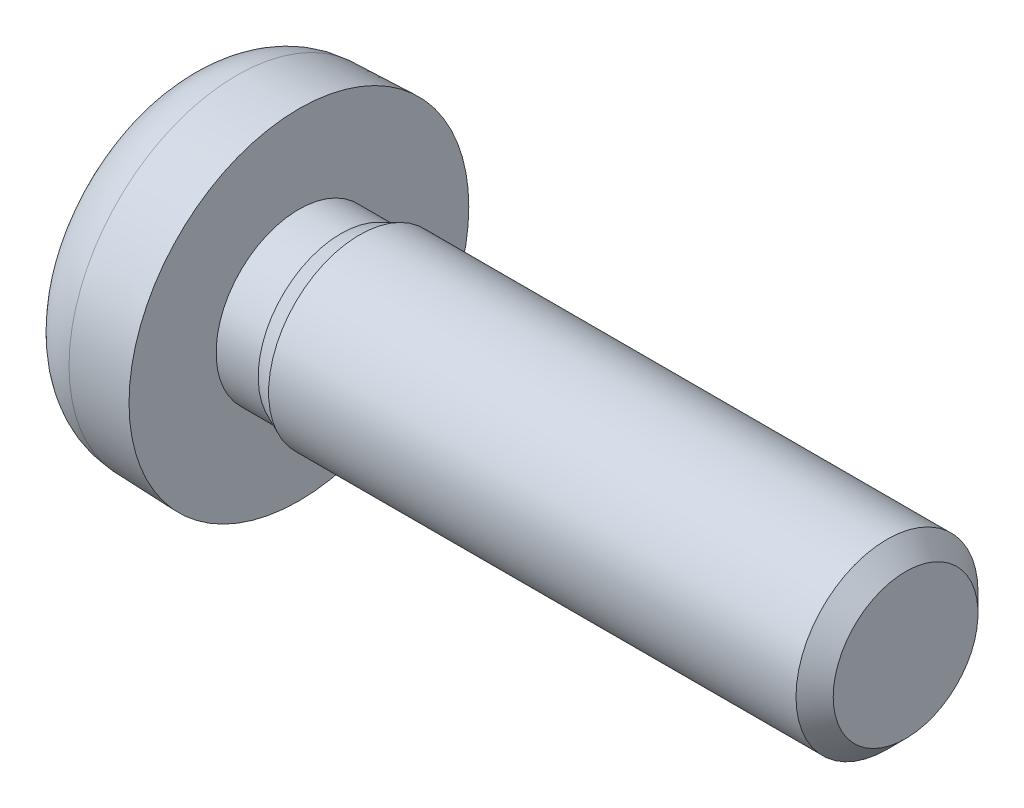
ISO-10303-21;
HEADER;
FILE_DESCRIPTION(('STEP AP214'),'2;1');
FILE_NAME('part.step','',(''),(''),'','','');
FILE_SCHEMA(('AUTOMOTIVE_DESIGN { 1 0 10303 214 1 1 1 1 }'));
ENDSEC;
DATA;
#1=APPLICATION_CONTEXT('core data for automotive mechanical design processes');
#2=APPLICATION_PROTOCOL_DEFINITION('international standard','automotive_design',2000,#1);
#3=PRODUCT_CONTEXT('',#1,'mechanical');
#4=PRODUCT('Part','Part','',(#3));
#5=PRODUCT_RELATED_PRODUCT_CATEGORY('part','',(#4));
#6=PRODUCT_DEFINITION_FORMATION('','',#4);
#7=PRODUCT_DEFINITION_CONTEXT('part definition',#1,'design');
#8=PRODUCT_DEFINITION('design','',#6,#7);
#9=PRODUCT_DEFINITION_SHAPE('','',#8);
#10=(LENGTH_UNIT() NAMED_UNIT(*) SI_UNIT(.MILLI.,.METRE.));
#11=(NAMED_UNIT(*) PLANE_ANGLE_UNIT() SI_UNIT($,.RADIAN.));
#12=(NAMED_UNIT(*) SI_UNIT($,.STERADIAN.) SOLID_ANGLE_UNIT());
#13=UNCERTAINTY_MEASURE_WITH_UNIT(LENGTH_MEASURE(1.E-05),#10,'distance_accuracy_value','');
#14=(GEOMETRIC_REPRESENTATION_CONTEXT(3) GLOBAL_UNCERTAINTY_ASSIGNED_CONTEXT((#13)) GLOBAL_UNIT_ASSIGNED_CONTEXT((#10,
#11,#12)) REPRESENTATION_CONTEXT('',''));
#15=CARTESIAN_POINT('',(0.,0.,0.));
#16=DIRECTION('',(0.,0.,1.));
#17=DIRECTION('',(1.,0.,0.));
#18=AXIS2_PLACEMENT_3D('',#15,#16,#17);
#19=CARTESIAN_POINT('',(-0.753422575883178,-0.466357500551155,0.466357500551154));
#20=DIRECTION('',(1.,0.,0.));
#21=DIRECTION('',(0.,0.,-1.));
#22=AXIS2_PLACEMENT_3D('',#19,#20,#21);
#23=CONICAL_SURFACE('',#22,0.353585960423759,0.0872664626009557);
#24=CARTESIAN_POINT('',(-0.848979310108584,-0.452245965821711,0.121420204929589));
#25=CARTESIAN_POINT('',(-0.844196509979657,-0.442939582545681,0.121383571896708));
#26=CARTESIAN_POINT('',(-0.83946205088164,-0.433612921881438,0.121725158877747));
#27=CARTESIAN_POINT('',(-0.830134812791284,-0.414933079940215,0.12318775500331));
#28=CARTESIAN_POINT('',(-0.825542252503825,-0.405579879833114,0.124309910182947));
#29=CARTESIAN_POINT('',(-0.811967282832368,-0.377337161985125,0.128913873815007));
#30=CARTESIAN_POINT('',(-0.803295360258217,-0.358470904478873,0.13363517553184));
#31=CARTESIAN_POINT('',(-0.789929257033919,-0.32671623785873,0.144691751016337));
#32=CARTESIAN_POINT('',(-0.784814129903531,-0.313696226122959,0.15014858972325));
#33=CARTESIAN_POINT('',(-0.775899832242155,-0.288159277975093,0.162904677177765));
#34=CARTESIAN_POINT('',(-0.772094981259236,-0.275640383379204,0.170195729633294));
#35=CARTESIAN_POINT('',(-0.76679078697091,-0.25333625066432,0.185339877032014));
#36=CARTESIAN_POINT('',(-0.765021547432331,-0.243432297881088,0.192920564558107));
#37=CARTESIAN_POINT('',(-0.7630590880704,-0.224498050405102,0.209282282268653));
#38=CARTESIAN_POINT('',(-0.762864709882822,-0.215467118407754,0.218062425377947));
#39=CARTESIAN_POINT('',(-0.764082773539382,-0.198567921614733,0.23655334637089));
#40=CARTESIAN_POINT('',(-0.765493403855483,-0.190698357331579,0.246263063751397));
#41=CARTESIAN_POINT('',(-0.76969668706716,-0.176252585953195,0.266330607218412));
#42=CARTESIAN_POINT('',(-0.772491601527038,-0.169678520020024,0.276689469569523));
#43=CARTESIAN_POINT('',(-0.780492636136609,-0.155426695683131,0.302141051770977));
#44=CARTESIAN_POINT('',(-0.78621752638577,-0.148401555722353,0.317433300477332));
#45=CARTESIAN_POINT('',(-0.798944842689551,-0.136825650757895,0.348433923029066));
#46=CARTESIAN_POINT('',(-0.805950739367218,-0.132281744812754,0.364143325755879));
#47=CARTESIAN_POINT('',(-0.818957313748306,-0.126322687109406,0.391995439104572));
#48=CARTESIAN_POINT('',(-0.824807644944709,-0.124423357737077,0.404109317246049));
#49=CARTESIAN_POINT('',(-0.836743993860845,-0.121953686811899,0.42824477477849));
#50=CARTESIAN_POINT('',(-0.84282793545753,-0.121373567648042,0.440266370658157));
#51=CARTESIAN_POINT('',(-0.848979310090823,-0.121420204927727,0.452245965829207));
#52=B_SPLINE_CURVE_WITH_KNOTS('',3,(#24,#25,#26,#27,#28,#29,#30,#31,#32,#33,#34,#35,#36,#37,#38,
#39,#40,#41,#42,#43,#44,#45,#46,#47,#48,#49,#50,#51),.UNSPECIFIED.,.F.,.F.,(4,2,2,2,2,2,2,2,2,2,
2,2,2,4),(0.,0.0313715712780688,0.0627892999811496,0.126316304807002,0.17122667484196,
0.215939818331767,0.253563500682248,0.291159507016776,0.328713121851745,0.366328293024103,
0.419365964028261,0.472549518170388,0.513242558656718,0.553632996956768),.UNSPECIFIED.);
#53=CARTESIAN_POINT('',(-0.848979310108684,-0.452245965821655,0.12142020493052));
#54=VERTEX_POINT('',#53);
#55=CARTESIAN_POINT('',(-0.848979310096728,-0.121420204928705,0.452245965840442));
#56=VERTEX_POINT('',#55);
#57=EDGE_CURVE('E270',#54,#56,#52,.T.);
#58=ORIENTED_EDGE('',*,*,#57,.F.);
#59=DIRECTION('',(0.996194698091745,0.003562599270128,-0.0870828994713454));
#60=VECTOR('',#59,1.);
#61=CARTESIAN_POINT('',(-2.37249385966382,-0.457694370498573,0.254599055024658));
#62=LINE('',#61,#60);
#63=CARTESIAN_POINT('',(-2.3724938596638,-0.457694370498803,0.254599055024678));
#64=VERTEX_POINT('',#63);
#65=EDGE_CURVE('E351',#64,#54,#62,.T.);
#66=ORIENTED_EDGE('',*,*,#65,.F.);
#67=CARTESIAN_POINT('',(-2.37249385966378,-0.457694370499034,0.254599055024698));
#68=CARTESIAN_POINT('',(-2.37356341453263,-0.445761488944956,0.25517035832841));
#69=CARTESIAN_POINT('',(-2.37453254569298,-0.433870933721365,0.256762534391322));
#70=CARTESIAN_POINT('',(-2.37624646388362,-0.410510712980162,0.261905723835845));
#71=CARTESIAN_POINT('',(-2.37699136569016,-0.399040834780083,0.265455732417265));
#72=CARTESIAN_POINT('',(-2.37823489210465,-0.376837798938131,0.274435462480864));
#73=CARTESIAN_POINT('',(-2.37873335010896,-0.366105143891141,0.279866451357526));
#74=CARTESIAN_POINT('',(-2.37946872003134,-0.345697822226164,0.292451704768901));
#75=CARTESIAN_POINT('',(-2.37970571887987,-0.336022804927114,0.29960539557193));
#76=CARTESIAN_POINT('',(-2.37991084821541,-0.318049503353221,0.315396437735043));
#77=CARTESIAN_POINT('',(-2.3798802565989,-0.309744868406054,0.324026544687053));
#78=CARTESIAN_POINT('',(-2.37955415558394,-0.294692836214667,0.342547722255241));
#79=CARTESIAN_POINT('',(-2.37925864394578,-0.287945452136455,0.352438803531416));
#80=CARTESIAN_POINT('',(-2.3784118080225,-0.276200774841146,0.37319071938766));
#81=CARTESIAN_POINT('',(-2.37786066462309,-0.271202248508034,0.384050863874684));
#82=CARTESIAN_POINT('',(-2.37651909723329,-0.263092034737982,0.406425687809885));
#83=CARTESIAN_POINT('',(-2.37572897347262,-0.259977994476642,0.417939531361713));
#84=CARTESIAN_POINT('',(-2.3741180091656,-0.25613754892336,0.438900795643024));
#85=CARTESIAN_POINT('',(-2.37333684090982,-0.255052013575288,0.448286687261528));
#86=CARTESIAN_POINT('',(-2.37249385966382,-0.254599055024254,0.457694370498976));
#87=B_SPLINE_CURVE_WITH_KNOTS('',3,(#67,#68,#69,#70,#71,#72,#73,#74,#75,#76,#77,#78,#79,#80,#81,
#82,#83,#84,#85,#86),.UNSPECIFIED.,.F.,.F.,(4,2,2,2,2,2,2,2,2,4),(0.,0.0359378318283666,
0.0718572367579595,0.107800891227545,0.143732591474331,0.179492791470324,0.215253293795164,
0.250988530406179,0.28667905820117,0.315035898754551),.UNSPECIFIED.);
#88=CARTESIAN_POINT('',(-2.3724938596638,-0.254599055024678,0.457694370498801));
#89=VERTEX_POINT('',#88);
#90=EDGE_CURVE('E21',#64,#89,#87,.T.);
#91=ORIENTED_EDGE('',*,*,#90,.T.);
#92=DIRECTION('',(-0.996194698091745,-0.0870828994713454,0.00356259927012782));
#93=VECTOR('',#92,1.);
#94=CARTESIAN_POINT('',(-0.848979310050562,-0.121420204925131,0.452245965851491));
#95=LINE('',#94,#93);
#96=EDGE_CURVE('E173',#56,#89,#95,.T.);
#97=ORIENTED_EDGE('',*,*,#96,.F.);
#98=EDGE_LOOP('',(#58,#66,#91,#97));
#99=FACE_BOUND('',#98,.T.);
#100=ADVANCED_FACE('F17',(#99),#23,.T.);
#101=CARTESIAN_POINT('',(-1.03595510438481,0.,0.));
#102=DIRECTION('',(-1.,0.,0.));
#103=DIRECTION('',(0.,0.,1.));
#104=AXIS2_PLACEMENT_3D('',#101,#102,#103);
#105=CONICAL_SURFACE('',#104,0.819912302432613,0.462512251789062);
#106=CARTESIAN_POINT('',(-1.03595510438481,0.,0.));
#107=DIRECTION('',(-1.,0.,0.));
#108=DIRECTION('',(0.,1.,0.));
#109=AXIS2_PLACEMENT_3D('',#106,#107,#108);
#110=CIRCLE('',#109,0.819912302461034);
#111=CARTESIAN_POINT('',(-1.03595510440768,-0.810613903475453,-0.123131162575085));
#112=VERTEX_POINT('',#111);
#113=CARTESIAN_POINT('',(-1.0359551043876,-0.810613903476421,0.123131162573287));
#114=VERTEX_POINT('',#113);
#115=EDGE_CURVE('E580',#112,#114,#110,.T.);
#116=ORIENTED_EDGE('',*,*,#115,.F.);
#117=CARTESIAN_POINT('',(-2.13514045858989,-1.3536629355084,-0.197161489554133));
#118=CARTESIAN_POINT('',(-1.95194162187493,-1.26315737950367,-0.18482288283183));
#119=CARTESIAN_POINT('',(-1.76874342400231,-1.17265051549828,-0.172484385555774));
#120=CARTESIAN_POINT('',(-1.4023483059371,-0.991634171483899,-0.147807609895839));
#121=CARTESIAN_POINT('',(-1.21915138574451,-0.901124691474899,-0.13546933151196));
#122=CARTESIAN_POINT('',(-1.03595510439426,-0.810613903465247,-0.123131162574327));
#123=B_SPLINE_CURVE_WITH_KNOTS('',3,(#117,#118,#119,#120,#121,#122),.UNSPECIFIED.,.F.,.F.,(4,2,
4),(0.,0.614123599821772,1.22824719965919),.UNSPECIFIED.);
#124=CARTESIAN_POINT('',(-2.13514055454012,-1.35366298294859,-0.197161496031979));
#125=VERTEX_POINT('',#124);
#126=EDGE_CURVE('E371',#125,#112,#123,.T.);
#127=ORIENTED_EDGE('',*,*,#126,.F.);
#128=CARTESIAN_POINT('',(-2.13514065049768,0.,0.));
#129=DIRECTION('',(1.,0.,0.));
#130=DIRECTION('',(0.,0.,-1.));
#131=AXIS2_PLACEMENT_3D('',#128,#129,#130);
#132=CIRCLE('',#131,1.36794599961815);
#133=CARTESIAN_POINT('',(-2.13514055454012,-1.35366298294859,0.197161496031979));
#134=VERTEX_POINT('',#133);
#135=EDGE_CURVE('E419',#134,#125,#132,.T.);
#136=ORIENTED_EDGE('',*,*,#135,.F.);
#137=CARTESIAN_POINT('',(-1.03595510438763,-0.810613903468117,0.123131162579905));
#138=CARTESIAN_POINT('',(-1.21915138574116,-0.901124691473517,0.135469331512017));
#139=CARTESIAN_POINT('',(-1.40234830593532,-0.991634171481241,0.147807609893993));
#140=CARTESIAN_POINT('',(-1.76874342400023,-1.17265051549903,0.172484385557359));
#141=CARTESIAN_POINT('',(-1.95194162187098,-1.26315737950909,0.184822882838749));
#142=CARTESIAN_POINT('',(-2.13514045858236,-1.35366293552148,0.197161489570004));
#143=B_SPLINE_CURVE_WITH_KNOTS('',3,(#137,#138,#139,#140,#141,#142),.UNSPECIFIED.,.F.,.F.,(4,2,
4),(0.,0.614123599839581,1.22824719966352),.UNSPECIFIED.);
#144=EDGE_CURVE('E350',#114,#134,#143,.T.);
#145=ORIENTED_EDGE('',*,*,#144,.F.);
#146=EDGE_LOOP('',(#116,#127,#136,#145));
#147=FACE_BOUND('',#146,.T.);
#148=ADVANCED_FACE('F362',(#147),#105,.F.);
#149=CARTESIAN_POINT('',(-0.753422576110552,-0.466357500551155,-0.466357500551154));
#150=DIRECTION('',(1.,0.,0.));
#151=DIRECTION('',(0.,0.,-1.));
#152=AXIS2_PLACEMENT_3D('',#149,#150,#151);
#153=CONICAL_SURFACE('',#152,0.353585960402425,0.0872664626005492);
#154=CARTESIAN_POINT('',(-0.848979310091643,-0.121420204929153,-0.452245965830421));
#155=CARTESIAN_POINT('',(-0.844196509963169,-0.121383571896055,-0.442939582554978));
#156=CARTESIAN_POINT('',(-0.839462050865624,-0.12172515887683,-0.433612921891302));
#157=CARTESIAN_POINT('',(-0.830134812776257,-0.123187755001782,-0.414933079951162));
#158=CARTESIAN_POINT('',(-0.825542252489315,-0.12430991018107,-0.405579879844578));
#159=CARTESIAN_POINT('',(-0.811967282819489,-0.128913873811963,-0.377337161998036));
#160=CARTESIAN_POINT('',(-0.803295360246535,-0.13363517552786,-0.358470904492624));
#161=CARTESIAN_POINT('',(-0.789929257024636,-0.144691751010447,-0.326716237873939));
#162=CARTESIAN_POINT('',(-0.78481412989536,-0.150148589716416,-0.313696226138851));
#163=CARTESIAN_POINT('',(-0.775899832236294,-0.162904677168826,-0.288159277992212));
#164=CARTESIAN_POINT('',(-0.772094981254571,-0.170195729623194,-0.275640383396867));
#165=CARTESIAN_POINT('',(-0.76679078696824,-0.185339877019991,-0.253336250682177));
#166=CARTESIAN_POINT('',(-0.765021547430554,-0.192920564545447,-0.243432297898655));
#167=CARTESIAN_POINT('',(-0.763059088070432,-0.209282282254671,-0.224498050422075));
#168=CARTESIAN_POINT('',(-0.762864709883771,-0.218062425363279,-0.215467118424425));
#169=CARTESIAN_POINT('',(-0.764082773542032,-0.236553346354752,-0.198567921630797));
#170=CARTESIAN_POINT('',(-0.765493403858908,-0.24626306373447,-0.190698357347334));
#171=CARTESIAN_POINT('',(-0.769696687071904,-0.266330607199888,-0.176252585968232));
#172=CARTESIAN_POINT('',(-0.772491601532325,-0.276689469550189,-0.169678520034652));
#173=CARTESIAN_POINT('',(-0.78049263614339,-0.302141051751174,-0.155426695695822));
#174=CARTESIAN_POINT('',(-0.786217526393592,-0.317433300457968,-0.148401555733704));
#175=CARTESIAN_POINT('',(-0.798944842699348,-0.348433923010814,-0.136825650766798));
#176=CARTESIAN_POINT('',(-0.805950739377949,-0.3641433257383,-0.13228174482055));
#177=CARTESIAN_POINT('',(-0.818957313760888,-0.391995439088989,-0.126322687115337));
#178=CARTESIAN_POINT('',(-0.824807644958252,-0.404109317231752,-0.124423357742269));
#179=CARTESIAN_POINT('',(-0.836743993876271,-0.428244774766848,-0.121953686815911));
#180=CARTESIAN_POINT('',(-0.842827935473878,-0.440266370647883,-0.121373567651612));
#181=CARTESIAN_POINT('',(-0.848979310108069,-0.452245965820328,-0.121420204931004));
#182=B_SPLINE_CURVE_WITH_KNOTS('',3,(#154,#155,#156,#157,#158,#159,#160,#161,#162,#163,#164,
#165,#166,#167,#168,#169,#170,#171,#172,#173,#174,#175,#176,#177,#178,#179,#180,#181),
.UNSPECIFIED.,.F.,.F.,(4,2,2,2,2,2,2,2,2,2,2,2,2,4),(0.,0.0313715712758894,0.0627892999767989,
0.126316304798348,0.171226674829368,0.21593981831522,0.253563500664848,0.291159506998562,
0.328713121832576,0.366328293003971,0.419365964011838,0.472549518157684,0.513242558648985,
0.553632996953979),.UNSPECIFIED.);
#183=CARTESIAN_POINT('',(-0.848979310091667,-0.121420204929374,-0.452245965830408));
#184=VERTEX_POINT('',#183);
#185=CARTESIAN_POINT('',(-0.848979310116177,-0.452245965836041,-0.12142020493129));
#186=VERTEX_POINT('',#185);
#187=EDGE_CURVE('E327',#184,#186,#182,.T.);
#188=ORIENTED_EDGE('',*,*,#187,.F.);
#189=DIRECTION('',(0.996194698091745,0.0870828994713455,0.00356259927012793));
#190=VECTOR('',#189,1.);
#191=CARTESIAN_POINT('',(-2.37249385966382,-0.254599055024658,-0.457694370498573));
#192=LINE('',#191,#190);
#193=CARTESIAN_POINT('',(-2.37249385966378,-0.254599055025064,-0.457694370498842));
#194=VERTEX_POINT('',#193);
#195=EDGE_CURVE('E435',#194,#184,#192,.T.);
#196=ORIENTED_EDGE('',*,*,#195,.F.);
#197=CARTESIAN_POINT('',(-2.37249385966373,-0.25459905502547,-0.457694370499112));
#198=CARTESIAN_POINT('',(-2.37356341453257,-0.255170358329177,-0.445761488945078));
#199=CARTESIAN_POINT('',(-2.37453254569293,-0.25676253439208,-0.43387093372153));
#200=CARTESIAN_POINT('',(-2.37624646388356,-0.261905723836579,-0.410510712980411));
#201=CARTESIAN_POINT('',(-2.3769913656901,-0.265455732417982,-0.399040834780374));
#202=CARTESIAN_POINT('',(-2.37823489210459,-0.274435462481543,-0.376837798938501));
#203=CARTESIAN_POINT('',(-2.3787333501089,-0.279866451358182,-0.36610514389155));
#204=CARTESIAN_POINT('',(-2.37946872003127,-0.292451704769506,-0.345697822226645));
#205=CARTESIAN_POINT('',(-2.3797057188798,-0.299605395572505,-0.336022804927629));
#206=CARTESIAN_POINT('',(-2.37991084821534,-0.315396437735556,-0.318049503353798));
#207=CARTESIAN_POINT('',(-2.37988025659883,-0.324026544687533,-0.30974486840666));
#208=CARTESIAN_POINT('',(-2.37955415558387,-0.342547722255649,-0.294692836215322));
#209=CARTESIAN_POINT('',(-2.37925864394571,-0.352438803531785,-0.287945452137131));
#210=CARTESIAN_POINT('',(-2.37841180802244,-0.373190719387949,-0.276200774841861));
#211=CARTESIAN_POINT('',(-2.37786066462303,-0.384050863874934,-0.271202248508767));
#212=CARTESIAN_POINT('',(-2.37651909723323,-0.406425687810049,-0.263092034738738));
#213=CARTESIAN_POINT('',(-2.37572897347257,-0.417939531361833,-0.259977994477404));
#214=CARTESIAN_POINT('',(-2.37411800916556,-0.43890079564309,-0.256137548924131));
#215=CARTESIAN_POINT('',(-2.37333684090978,-0.448286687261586,-0.255052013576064));
#216=CARTESIAN_POINT('',(-2.37249385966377,-0.457694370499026,-0.254599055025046));
#217=B_SPLINE_CURVE_WITH_KNOTS('',3,(#197,#198,#199,#200,#201,#202,#203,#204,#205,#206,#207,
#208,#209,#210,#211,#212,#213,#214,#215,#216),.UNSPECIFIED.,.F.,.F.,(4,2,2,2,2,2,2,2,2,4),(0.,
0.0359378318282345,0.0718572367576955,0.107800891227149,0.143732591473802,0.179492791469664,
0.215253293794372,0.250988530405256,0.286679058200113,0.315035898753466),.UNSPECIFIED.);
#218=CARTESIAN_POINT('',(-2.37249385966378,-0.457694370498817,-0.254599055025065));
#219=VERTEX_POINT('',#218);
#220=EDGE_CURVE('E428',#194,#219,#217,.T.);
#221=ORIENTED_EDGE('',*,*,#220,.T.);
#222=DIRECTION('',(-0.996194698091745,-0.00356259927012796,-0.0870828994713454));
#223=VECTOR('',#222,1.);
#224=CARTESIAN_POINT('',(-0.848979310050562,-0.452245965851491,-0.121420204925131));
#225=LINE('',#224,#223);
#226=EDGE_CURVE('E426',#186,#219,#225,.T.);
#227=ORIENTED_EDGE('',*,*,#226,.F.);
#228=EDGE_LOOP('',(#188,#196,#221,#227));
#229=FACE_BOUND('',#228,.T.);
#230=ADVANCED_FACE('F365',(#229),#153,.T.);
#231=CARTESIAN_POINT('',(-1.03595510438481,0.,0.));
#232=DIRECTION('',(-1.,0.,0.));
#233=DIRECTION('',(0.,0.,1.));
#234=AXIS2_PLACEMENT_3D('',#231,#232,#233);
#235=CONICAL_SURFACE('',#234,0.819912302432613,0.462512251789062);
#236=CARTESIAN_POINT('',(-1.03595510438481,0.,0.));
#237=DIRECTION('',(-1.,0.,0.));
#238=DIRECTION('',(0.,1.,0.));
#239=AXIS2_PLACEMENT_3D('',#236,#237,#238);
#240=CIRCLE('',#239,0.819912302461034);
#241=CARTESIAN_POINT('',(-1.03595510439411,0.123131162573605,-0.8106139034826));
#242=VERTEX_POINT('',#241);
#243=CARTESIAN_POINT('',(-1.03595510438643,-0.123131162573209,-0.810613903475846));
#244=VERTEX_POINT('',#243);
#245=EDGE_CURVE('E573',#242,#244,#240,.T.);
#246=ORIENTED_EDGE('',*,*,#245,.F.);
#247=CARTESIAN_POINT('',(-2.13514045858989,0.197161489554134,-1.3536629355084));
#248=CARTESIAN_POINT('',(-1.9519416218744,0.184822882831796,-1.26315737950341));
#249=CARTESIAN_POINT('',(-1.76874342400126,0.172484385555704,-1.17265051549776));
#250=CARTESIAN_POINT('',(-1.402348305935,0.147807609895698,-0.991634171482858));
#251=CARTESIAN_POINT('',(-1.21915138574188,0.135469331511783,-0.901124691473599));
#252=CARTESIAN_POINT('',(-1.0359551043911,0.123131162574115,-0.810613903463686));
#253=B_SPLINE_CURVE_WITH_KNOTS('',3,(#247,#248,#249,#250,#251,#252),.UNSPECIFIED.,.F.,.F.,(4,2,
4),(0.,0.614123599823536,1.22824719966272),.UNSPECIFIED.);
#254=CARTESIAN_POINT('',(-2.13514055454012,0.19716149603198,-1.35366298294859));
#255=VERTEX_POINT('',#254);
#256=EDGE_CURVE('E468',#255,#242,#253,.T.);
#257=ORIENTED_EDGE('',*,*,#256,.F.);
#258=CARTESIAN_POINT('',(-2.13514065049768,0.,0.));
#259=DIRECTION('',(1.,0.,0.));
#260=DIRECTION('',(0.,0.,-1.));
#261=AXIS2_PLACEMENT_3D('',#258,#259,#260);
#262=CIRCLE('',#261,1.36794599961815);
#263=CARTESIAN_POINT('',(-2.13514055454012,-0.19716149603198,-1.35366298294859));
#264=VERTEX_POINT('',#263);
#265=EDGE_CURVE('E492',#264,#255,#262,.T.);
#266=ORIENTED_EDGE('',*,*,#265,.F.);
#267=CARTESIAN_POINT('',(-1.03595510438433,-0.123131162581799,-0.810613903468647));
#268=CARTESIAN_POINT('',(-1.21915138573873,-0.135469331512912,-0.901124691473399));
#269=CARTESIAN_POINT('',(-1.4023483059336,-0.147807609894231,-0.991634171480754));
#270=CARTESIAN_POINT('',(-1.76874342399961,-0.172484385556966,-1.17265051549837));
#271=CARTESIAN_POINT('',(-1.95194162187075,-0.184822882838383,-1.26315737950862));
#272=CARTESIAN_POINT('',(-2.13514045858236,-0.197161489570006,-1.35366293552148));
#273=B_SPLINE_CURVE_WITH_KNOTS('',3,(#267,#268,#269,#270,#271,#272),.UNSPECIFIED.,.F.,.F.,(4,2,
4),(0.,0.614123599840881,1.22824719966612),.UNSPECIFIED.);
#274=EDGE_CURVE('E485',#244,#264,#273,.T.);
#275=ORIENTED_EDGE('',*,*,#274,.F.);
#276=EDGE_LOOP('',(#246,#257,#266,#275));
#277=FACE_BOUND('',#276,.T.);
#278=ADVANCED_FACE('F478',(#277),#235,.F.);
#279=CARTESIAN_POINT('',(-0.753422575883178,0.466357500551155,-0.466357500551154));
#280=DIRECTION('',(1.,0.,0.));
#281=DIRECTION('',(0.,0.,-1.));
#282=AXIS2_PLACEMENT_3D('',#279,#280,#281);
#283=CONICAL_SURFACE('',#282,0.353585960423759,0.0872664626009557);
#284=CARTESIAN_POINT('',(-0.848979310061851,0.452245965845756,-0.121420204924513));
#285=CARTESIAN_POINT('',(-0.844196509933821,0.442939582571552,-0.121383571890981));
#286=CARTESIAN_POINT('',(-0.839462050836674,0.433612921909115,-0.121725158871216));
#287=CARTESIAN_POINT('',(-0.830134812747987,0.414933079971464,-0.12318775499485));
#288=CARTESIAN_POINT('',(-0.825542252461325,0.405579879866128,-0.124309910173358));
#289=CARTESIAN_POINT('',(-0.811967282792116,0.377337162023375,-0.128913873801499));
#290=CARTESIAN_POINT('',(-0.803295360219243,0.358470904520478,-0.133635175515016));
#291=CARTESIAN_POINT('',(-0.789929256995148,0.326716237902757,-0.144691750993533));
#292=CARTESIAN_POINT('',(-0.784814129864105,0.313696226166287,-0.150148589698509));
#293=CARTESIAN_POINT('',(-0.775899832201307,0.288159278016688,-0.162904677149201));
#294=CARTESIAN_POINT('',(-0.772094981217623,0.275640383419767,-0.170195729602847));
#295=CARTESIAN_POINT('',(-0.766790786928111,0.253336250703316,-0.185339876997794));
#296=CARTESIAN_POINT('',(-0.765021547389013,0.243432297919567,-0.192920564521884));
#297=CARTESIAN_POINT('',(-0.763059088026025,0.224498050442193,-0.209282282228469));
#298=CARTESIAN_POINT('',(-0.762864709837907,0.215467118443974,-0.218062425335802));
#299=CARTESIAN_POINT('',(-0.764082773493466,0.198567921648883,-0.236553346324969));
#300=CARTESIAN_POINT('',(-0.765493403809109,0.190698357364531,-0.246263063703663));
#301=CARTESIAN_POINT('',(-0.769696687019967,0.176252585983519,-0.266330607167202));
#302=CARTESIAN_POINT('',(-0.772491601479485,0.169678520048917,-0.276689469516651));
#303=CARTESIAN_POINT('',(-0.780492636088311,0.155426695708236,-0.302141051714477));
#304=CARTESIAN_POINT('',(-0.786217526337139,0.148401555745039,-0.317433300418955));
#305=CARTESIAN_POINT('',(-0.798944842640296,0.136825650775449,-0.348433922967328));
#306=CARTESIAN_POINT('',(-0.805950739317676,0.132281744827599,-0.364143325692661));
#307=CARTESIAN_POINT('',(-0.818957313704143,0.126322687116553,-0.391995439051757));
#308=CARTESIAN_POINT('',(-0.82480764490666,0.124423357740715,-0.404109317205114));
#309=CARTESIAN_POINT('',(-0.836743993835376,0.121953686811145,-0.428244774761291));
#310=CARTESIAN_POINT('',(-0.842827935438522,0.121373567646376,-0.440266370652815));
#311=CARTESIAN_POINT('',(-0.848979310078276,0.121420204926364,-0.452245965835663));
#312=B_SPLINE_CURVE_WITH_KNOTS('',3,(#284,#285,#286,#287,#288,#289,#290,#291,#292,#293,#294,
#295,#296,#297,#298,#299,#300,#301,#302,#303,#304,#305,#306,#307,#308,#309,#310,#311),
.UNSPECIFIED.,.F.,.F.,(4,2,2,2,2,2,2,2,2,2,2,2,2,4),(0.,0.0313715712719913,0.0627892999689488,
0.126316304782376,0.171226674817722,0.215939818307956,0.253563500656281,0.291159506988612,
0.32871312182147,0.366328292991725,0.419365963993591,0.472549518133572,0.513242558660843,
0.553632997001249),.UNSPECIFIED.);
#313=CARTESIAN_POINT('',(-0.848979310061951,0.452245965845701,-0.121420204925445));
#314=VERTEX_POINT('',#313);
#315=CARTESIAN_POINT('',(-0.848979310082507,0.121420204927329,-0.452245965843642));
#316=VERTEX_POINT('',#315);
#317=EDGE_CURVE('E319',#314,#316,#312,.T.);
#318=ORIENTED_EDGE('',*,*,#317,.F.);
#319=DIRECTION('',(0.996194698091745,-0.003562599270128,0.0870828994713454));
#320=VECTOR('',#319,1.);
#321=CARTESIAN_POINT('',(-2.37249385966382,0.457694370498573,-0.254599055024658));
#322=LINE('',#321,#320);
#323=CARTESIAN_POINT('',(-2.3724938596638,0.457694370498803,-0.254599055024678));
#324=VERTEX_POINT('',#323);
#325=EDGE_CURVE('E503',#324,#314,#322,.T.);
#326=ORIENTED_EDGE('',*,*,#325,.F.);
#327=CARTESIAN_POINT('',(-2.37249385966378,0.457694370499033,-0.254599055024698));
#328=CARTESIAN_POINT('',(-2.37356341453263,0.445761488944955,-0.255170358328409));
#329=CARTESIAN_POINT('',(-2.37453254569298,0.433870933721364,-0.256762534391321));
#330=CARTESIAN_POINT('',(-2.37624646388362,0.410510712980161,-0.261905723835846));
#331=CARTESIAN_POINT('',(-2.37699136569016,0.399040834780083,-0.265455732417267));
#332=CARTESIAN_POINT('',(-2.37823489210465,0.37683779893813,-0.274435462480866));
#333=CARTESIAN_POINT('',(-2.37873335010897,0.366105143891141,-0.279866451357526));
#334=CARTESIAN_POINT('',(-2.37946872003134,0.345697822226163,-0.292451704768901));
#335=CARTESIAN_POINT('',(-2.37970571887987,0.336022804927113,-0.29960539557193));
#336=CARTESIAN_POINT('',(-2.37991084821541,0.31804950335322,-0.315396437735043));
#337=CARTESIAN_POINT('',(-2.3798802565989,0.309744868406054,-0.324026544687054));
#338=CARTESIAN_POINT('',(-2.37955415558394,0.294692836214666,-0.342547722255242));
#339=CARTESIAN_POINT('',(-2.37925864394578,0.287945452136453,-0.352438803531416));
#340=CARTESIAN_POINT('',(-2.3784118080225,0.276200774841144,-0.37319071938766));
#341=CARTESIAN_POINT('',(-2.37786066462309,0.271202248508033,-0.384050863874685));
#342=CARTESIAN_POINT('',(-2.37651909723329,0.263092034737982,-0.406425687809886));
#343=CARTESIAN_POINT('',(-2.37572897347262,0.259977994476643,-0.417939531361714));
#344=CARTESIAN_POINT('',(-2.3741180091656,0.256137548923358,-0.438900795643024));
#345=CARTESIAN_POINT('',(-2.37333684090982,0.255052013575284,-0.448286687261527));
#346=CARTESIAN_POINT('',(-2.37249385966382,0.254599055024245,-0.457694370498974));
#347=B_SPLINE_CURVE_WITH_KNOTS('',3,(#327,#328,#329,#330,#331,#332,#333,#334,#335,#336,#337,
#338,#339,#340,#341,#342,#343,#344,#345,#346),.UNSPECIFIED.,.F.,.F.,(4,2,2,2,2,2,2,2,2,4),(0.,
0.0359378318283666,0.0718572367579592,0.107800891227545,0.143732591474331,0.179492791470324,
0.215253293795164,0.250988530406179,0.28667905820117,0.315035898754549),.UNSPECIFIED.);
#348=CARTESIAN_POINT('',(-2.37249385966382,0.254599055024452,-0.457694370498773));
#349=VERTEX_POINT('',#348);
#350=EDGE_CURVE('E433',#324,#349,#347,.T.);
#351=ORIENTED_EDGE('',*,*,#350,.T.);
#352=DIRECTION('',(-0.996194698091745,0.0870828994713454,-0.00356259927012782));
#353=VECTOR('',#352,1.);
#354=CARTESIAN_POINT('',(-0.848979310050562,0.121420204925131,-0.452245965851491));
#355=LINE('',#354,#353);
#356=EDGE_CURVE('E500',#316,#349,#355,.T.);
#357=ORIENTED_EDGE('',*,*,#356,.F.);
#358=EDGE_LOOP('',(#318,#326,#351,#357));
#359=FACE_BOUND('',#358,.T.);
#360=ADVANCED_FACE('F481',(#359),#283,.T.);
#361=CARTESIAN_POINT('',(-1.03595510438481,0.,0.));
#362=DIRECTION('',(-1.,0.,0.));
#363=DIRECTION('',(0.,0.,1.));
#364=AXIS2_PLACEMENT_3D('',#361,#362,#363);
#365=CONICAL_SURFACE('',#364,0.819912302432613,0.462512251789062);
#366=CARTESIAN_POINT('',(-1.03595510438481,0.,0.));
#367=DIRECTION('',(-1.,0.,0.));
#368=DIRECTION('',(0.,1.,0.));
#369=AXIS2_PLACEMENT_3D('',#366,#367,#368);
#370=CIRCLE('',#369,0.819912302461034);
#371=CARTESIAN_POINT('',(-1.03595510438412,0.810613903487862,0.123131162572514));
#372=VERTEX_POINT('',#371);
#373=CARTESIAN_POINT('',(-1.03595510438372,0.810613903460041,-0.123131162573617));
#374=VERTEX_POINT('',#373);
#375=EDGE_CURVE('E269',#372,#374,#370,.T.);
#376=ORIENTED_EDGE('',*,*,#375,.F.);
#377=CARTESIAN_POINT('',(-2.13514045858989,1.3536629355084,0.197161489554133));
#378=CARTESIAN_POINT('',(-1.95194162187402,1.26315737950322,0.184822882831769));
#379=CARTESIAN_POINT('',(-1.76874342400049,1.17265051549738,0.172484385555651));
#380=CARTESIAN_POINT('',(-1.40234830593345,0.991634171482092,0.147807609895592));
#381=CARTESIAN_POINT('',(-1.21915138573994,0.901124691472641,0.135469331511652));
#382=CARTESIAN_POINT('',(-1.03595510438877,0.810613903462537,0.123131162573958));
#383=B_SPLINE_CURVE_WITH_KNOTS('',3,(#377,#378,#379,#380,#381,#382),.UNSPECIFIED.,.F.,.F.,(4,2,
4),(0.,0.614123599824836,1.22824719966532),.UNSPECIFIED.);
#384=CARTESIAN_POINT('',(-2.13514055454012,1.35366298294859,0.197161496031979));
#385=VERTEX_POINT('',#384);
#386=EDGE_CURVE('E535',#385,#372,#383,.T.);
#387=ORIENTED_EDGE('',*,*,#386,.F.);
#388=CARTESIAN_POINT('',(-2.13514065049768,0.,0.));
#389=DIRECTION('',(1.,0.,0.));
#390=DIRECTION('',(0.,0.,-1.));
#391=AXIS2_PLACEMENT_3D('',#388,#389,#390);
#392=CIRCLE('',#391,1.36794599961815);
#393=CARTESIAN_POINT('',(-2.13514055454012,1.35366298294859,-0.197161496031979));
#394=VERTEX_POINT('',#393);
#395=EDGE_CURVE('E508',#394,#385,#392,.T.);
#396=ORIENTED_EDGE('',*,*,#395,.F.);
#397=CARTESIAN_POINT('',(-1.03595510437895,0.810613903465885,-0.123131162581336));
#398=CARTESIAN_POINT('',(-1.21915138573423,0.901124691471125,-0.135469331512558));
#399=CARTESIAN_POINT('',(-1.40234830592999,0.991634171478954,-0.14780760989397));
#400=CARTESIAN_POINT('',(-1.7687434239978,1.17265051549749,-0.172484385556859));
#401=CARTESIAN_POINT('',(-1.95194162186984,1.26315737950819,-0.184822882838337));
#402=CARTESIAN_POINT('',(-2.13514045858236,1.35366293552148,-0.197161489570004));
#403=B_SPLINE_CURVE_WITH_KNOTS('',3,(#397,#398,#399,#400,#401,#402),.UNSPECIFIED.,.F.,.F.,(4,2,
4),(0.,0.614123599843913,1.22824719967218),.UNSPECIFIED.);
#404=EDGE_CURVE('E526',#374,#394,#403,.T.);
#405=ORIENTED_EDGE('',*,*,#404,.F.);
#406=EDGE_LOOP('',(#376,#387,#396,#405));
#407=FACE_BOUND('',#406,.T.);
#408=ADVANCED_FACE('F530',(#407),#365,.F.);
#409=CARTESIAN_POINT('',(-0.753422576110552,0.466357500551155,0.466357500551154));
#410=DIRECTION('',(1.,0.,0.));
#411=DIRECTION('',(0.,0.,-1.));
#412=AXIS2_PLACEMENT_3D('',#409,#410,#411);
#413=CONICAL_SURFACE('',#412,0.353585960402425,0.0872664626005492);
#414=CARTESIAN_POINT('',(-0.848979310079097,0.12142020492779,0.452245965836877));
#415=CARTESIAN_POINT('',(-0.844196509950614,0.121383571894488,0.442939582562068));
#416=CARTESIAN_POINT('',(-0.839462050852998,0.121725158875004,0.433612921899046));
#417=CARTESIAN_POINT('',(-0.830134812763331,0.123187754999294,0.414933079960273));
#418=CARTESIAN_POINT('',(-0.82554225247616,0.124309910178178,0.405579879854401));
#419=CARTESIAN_POINT('',(-0.811967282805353,0.128913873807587,0.37733716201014));
#420=CARTESIAN_POINT('',(-0.803295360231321,0.133635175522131,0.358470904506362));
#421=CARTESIAN_POINT('',(-0.789929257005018,0.1446917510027,0.326716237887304));
#422=CARTESIAN_POINT('',(-0.784814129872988,0.150148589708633,0.313696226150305));
#423=CARTESIAN_POINT('',(-0.775899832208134,0.162904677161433,0.288159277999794));
#424=CARTESIAN_POINT('',(-0.772094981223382,0.170195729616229,0.275640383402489));
#425=CARTESIAN_POINT('',(-0.766790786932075,0.185339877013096,0.253336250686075));
#426=CARTESIAN_POINT('',(-0.76502154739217,0.192920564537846,0.243432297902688));
#427=CARTESIAN_POINT('',(-0.763059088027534,0.209282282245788,0.224498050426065));
#428=CARTESIAN_POINT('',(-0.762864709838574,0.218062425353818,0.215467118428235));
#429=CARTESIAN_POINT('',(-0.764082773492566,0.23655334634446,0.198567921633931));
#430=CARTESIAN_POINT('',(-0.765493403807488,0.246263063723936,0.190698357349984));
#431=CARTESIAN_POINT('',(-0.769696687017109,0.266330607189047,0.176252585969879));
#432=CARTESIAN_POINT('',(-0.772491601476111,0.276689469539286,0.169678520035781));
#433=CARTESIAN_POINT('',(-0.780492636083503,0.302141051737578,0.155426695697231));
#434=CARTESIAN_POINT('',(-0.786217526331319,0.317433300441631,0.148401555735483));
#435=CARTESIAN_POINT('',(-0.798944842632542,0.34843392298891,0.136825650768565));
#436=CARTESIAN_POINT('',(-0.805950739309,0.364143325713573,0.132281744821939));
#437=CARTESIAN_POINT('',(-0.818957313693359,0.39199543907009,0.126322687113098));
#438=CARTESIAN_POINT('',(-0.824807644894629,0.404109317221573,0.124423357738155));
#439=CARTESIAN_POINT('',(-0.836743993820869,0.428244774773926,0.121953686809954));
#440=CARTESIAN_POINT('',(-0.842827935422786,0.440266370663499,0.121373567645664));
#441=CARTESIAN_POINT('',(-0.848979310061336,0.452245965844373,0.121420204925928));
#442=B_SPLINE_CURVE_WITH_KNOTS('',3,(#414,#415,#416,#417,#418,#419,#420,#421,#422,#423,#424,
#425,#426,#427,#428,#429,#430,#431,#432,#433,#434,#435,#436,#437,#438,#439,#440,#441),
.UNSPECIFIED.,.F.,.F.,(4,2,2,2,2,2,2,2,2,2,2,2,2,4),(0.,0.031371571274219,0.0627892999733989,
0.126316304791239,0.17122667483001,0.215939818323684,0.253563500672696,0.291159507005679,
0.328713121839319,0.366328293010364,0.419365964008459,0.472549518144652,0.513242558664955,
0.553632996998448),.UNSPECIFIED.);
#443=CARTESIAN_POINT('',(-0.84897931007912,0.121420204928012,0.452245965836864));
#444=VERTEX_POINT('',#443);
#445=CARTESIAN_POINT('',(-0.848979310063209,0.452245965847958,0.121420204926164));
#446=VERTEX_POINT('',#445);
#447=EDGE_CURVE('E263',#444,#446,#442,.T.);
#448=ORIENTED_EDGE('',*,*,#447,.F.);
#449=DIRECTION('',(0.996194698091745,-0.0870828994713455,-0.00356259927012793));
#450=VECTOR('',#449,1.);
#451=CARTESIAN_POINT('',(-2.37249385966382,0.254599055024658,0.457694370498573));
#452=LINE('',#451,#450);
#453=CARTESIAN_POINT('',(-2.37249385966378,0.254599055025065,0.457694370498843));
#454=VERTEX_POINT('',#453);
#455=EDGE_CURVE('E561',#454,#444,#452,.T.);
#456=ORIENTED_EDGE('',*,*,#455,.F.);
#457=CARTESIAN_POINT('',(-2.37249385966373,0.254599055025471,0.457694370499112));
#458=CARTESIAN_POINT('',(-2.37356341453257,0.255170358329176,0.445761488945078));
#459=CARTESIAN_POINT('',(-2.37453254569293,0.256762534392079,0.433870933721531));
#460=CARTESIAN_POINT('',(-2.37624646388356,0.261905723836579,0.410510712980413));
#461=CARTESIAN_POINT('',(-2.3769913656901,0.265455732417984,0.399040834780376));
#462=CARTESIAN_POINT('',(-2.37823489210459,0.274435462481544,0.376837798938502));
#463=CARTESIAN_POINT('',(-2.3787333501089,0.279866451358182,0.36610514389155));
#464=CARTESIAN_POINT('',(-2.37946872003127,0.292451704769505,0.345697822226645));
#465=CARTESIAN_POINT('',(-2.3797057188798,0.299605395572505,0.33602280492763));
#466=CARTESIAN_POINT('',(-2.37991084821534,0.315396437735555,0.318049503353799));
#467=CARTESIAN_POINT('',(-2.37988025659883,0.324026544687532,0.309744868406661));
#468=CARTESIAN_POINT('',(-2.37955415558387,0.342547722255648,0.294692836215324));
#469=CARTESIAN_POINT('',(-2.37925864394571,0.352438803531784,0.287945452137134));
#470=CARTESIAN_POINT('',(-2.37841180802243,0.37319071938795,0.276200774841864));
#471=CARTESIAN_POINT('',(-2.37786066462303,0.384050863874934,0.271202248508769));
#472=CARTESIAN_POINT('',(-2.37651909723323,0.40642568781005,0.263092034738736));
#473=CARTESIAN_POINT('',(-2.37572897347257,0.417939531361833,0.259977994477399));
#474=CARTESIAN_POINT('',(-2.37411800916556,0.438900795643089,0.256137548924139));
#475=CARTESIAN_POINT('',(-2.37333684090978,0.448286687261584,0.255052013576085));
#476=CARTESIAN_POINT('',(-2.37249385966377,0.457694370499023,0.254599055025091));
#477=B_SPLINE_CURVE_WITH_KNOTS('',3,(#457,#458,#459,#460,#461,#462,#463,#464,#465,#466,#467,
#468,#469,#470,#471,#472,#473,#474,#475,#476),.UNSPECIFIED.,.F.,.F.,(4,2,2,2,2,2,2,2,2,4),(0.,
0.0359378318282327,0.0718572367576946,0.107800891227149,0.143732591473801,0.179492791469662,
0.21525329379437,0.250988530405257,0.286679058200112,0.315035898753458),.UNSPECIFIED.);
#478=CARTESIAN_POINT('',(-2.37249385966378,0.457694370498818,0.254599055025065));
#479=VERTEX_POINT('',#478);
#480=EDGE_CURVE('E562',#454,#479,#477,.T.);
#481=ORIENTED_EDGE('',*,*,#480,.T.);
#482=DIRECTION('',(-0.996194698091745,0.00356259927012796,0.0870828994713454));
#483=VECTOR('',#482,1.);
#484=CARTESIAN_POINT('',(-0.848979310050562,0.452245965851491,0.121420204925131));
#485=LINE('',#484,#483);
#486=EDGE_CURVE('E544',#446,#479,#485,.T.);
#487=ORIENTED_EDGE('',*,*,#486,.F.);
#488=EDGE_LOOP('',(#448,#456,#481,#487));
#489=FACE_BOUND('',#488,.T.);
#490=ADVANCED_FACE('F275',(#489),#413,.T.);
#491=CARTESIAN_POINT('',(-0.600000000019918,5.6843418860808E-11,0.));
#492=DIRECTION('',(-1.,0.,0.));
#493=DIRECTION('',(0.,0.,1.));
#494=AXIS2_PLACEMENT_3D('',#491,#492,#493);
#495=CONICAL_SURFACE('',#494,0.,1.08210413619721);
#496=CARTESIAN_POINT('',(-1.03595510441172,-0.810613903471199,-0.123131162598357));
#497=CARTESIAN_POINT('',(-1.02027284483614,-0.780802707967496,-0.122977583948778));
#498=CARTESIAN_POINT('',(-1.00460309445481,-0.750984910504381,-0.122825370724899));
#499=CARTESIAN_POINT('',(-0.973304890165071,-0.691327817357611,-0.122525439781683));
#500=CARTESIAN_POINT('',(-0.95767643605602,-0.661488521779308,-0.122377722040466));
#501=CARTESIAN_POINT('',(-0.926476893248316,-0.60177974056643,-0.122088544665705));
#502=CARTESIAN_POINT('',(-0.910905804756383,-0.571910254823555,-0.121947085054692));
#503=CARTESIAN_POINT('',(-0.879860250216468,-0.51212089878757,-0.121674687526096));
#504=CARTESIAN_POINT('',(-0.864385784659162,-0.482201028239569,-0.121543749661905));
#505=CARTESIAN_POINT('',(-0.848979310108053,-0.452245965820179,-0.121420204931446));
#506=B_SPLINE_CURVE_WITH_KNOTS('',3,(#496,#497,#498,#499,#500,#501,#502,#503,#504,#505),
.UNSPECIFIED.,.F.,.F.,(4,2,2,2,4),(0.,0.101054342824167,0.202108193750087,0.303162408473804,
0.404217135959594),.UNSPECIFIED.);
#507=EDGE_CURVE('E311',#112,#186,#506,.T.);
#508=ORIENTED_EDGE('',*,*,#507,.F.);
#509=ORIENTED_EDGE('',*,*,#115,.T.);
#510=CARTESIAN_POINT('',(-0.848979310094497,-0.452245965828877,0.121420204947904));
#511=CARTESIAN_POINT('',(-0.864385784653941,-0.482201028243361,0.121543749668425));
#512=CARTESIAN_POINT('',(-0.879860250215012,-0.512120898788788,0.121674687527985));
#513=CARTESIAN_POINT('',(-0.910905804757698,-0.571910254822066,0.121947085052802));
#514=CARTESIAN_POINT('',(-0.926476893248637,-0.601779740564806,0.122088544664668));
#515=CARTESIAN_POINT('',(-0.957676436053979,-0.661488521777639,0.122377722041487));
#516=CARTESIAN_POINT('',(-0.973304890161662,-0.69132781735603,0.12252543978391));
#517=CARTESIAN_POINT('',(-1.00460309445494,-0.750984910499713,0.12282537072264));
#518=CARTESIAN_POINT('',(-1.02027284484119,-0.780802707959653,0.122977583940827));
#519=CARTESIAN_POINT('',(-1.03595510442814,-0.810613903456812,0.123131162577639));
#520=B_SPLINE_CURVE_WITH_KNOTS('',3,(#510,#511,#512,#513,#514,#515,#516,#517,#518,#519),
.UNSPECIFIED.,.F.,.F.,(4,2,2,2,4),(0.,0.10105472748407,0.202108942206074,0.303162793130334,
0.404217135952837),.UNSPECIFIED.);
#521=EDGE_CURVE('E344',#54,#114,#520,.T.);
#522=ORIENTED_EDGE('',*,*,#521,.F.);
#523=ORIENTED_EDGE('',*,*,#57,.T.);
#524=CARTESIAN_POINT('',(-1.03595510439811,-0.1231311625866,0.810613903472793));
#525=CARTESIAN_POINT('',(-1.0202728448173,-0.122977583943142,0.780802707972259));
#526=CARTESIAN_POINT('',(-1.00460309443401,-0.122825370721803,0.750984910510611));
#527=CARTESIAN_POINT('',(-0.973304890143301,-0.122525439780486,0.691327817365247));
#528=CARTESIAN_POINT('',(-0.957676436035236,-0.122377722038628,0.661488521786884));
#529=CARTESIAN_POINT('',(-0.926476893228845,-0.122088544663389,0.601779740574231));
#530=CARTESIAN_POINT('',(-0.910905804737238,-0.12194708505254,0.571910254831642));
#531=CARTESIAN_POINT('',(-0.879860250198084,-0.121674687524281,0.51212089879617));
#532=CARTESIAN_POINT('',(-0.864385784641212,-0.121543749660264,0.482201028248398));
#533=CARTESIAN_POINT('',(-0.848979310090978,-0.12142020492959,0.452245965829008));
#534=B_SPLINE_CURVE_WITH_KNOTS('',3,(#524,#525,#526,#527,#528,#529,#530,#531,#532,#533),
.UNSPECIFIED.,.F.,.F.,(4,2,2,2,4),(0.,0.101054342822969,0.202108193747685,0.303162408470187,
0.404217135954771),.UNSPECIFIED.);
#535=CARTESIAN_POINT('',(-1.03595510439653,-0.123131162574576,0.810613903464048));
#536=VERTEX_POINT('',#535);
#537=EDGE_CURVE('E250',#536,#56,#534,.T.);
#538=ORIENTED_EDGE('',*,*,#537,.F.);
#539=CARTESIAN_POINT('',(-1.03595510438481,0.,0.));
#540=DIRECTION('',(-1.,0.,0.));
#541=DIRECTION('',(0.,1.,0.));
#542=AXIS2_PLACEMENT_3D('',#539,#540,#541);
#543=CIRCLE('',#542,0.819912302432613);
#544=CARTESIAN_POINT('',(-1.03595510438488,0.123131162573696,0.810613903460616));
#545=VERTEX_POINT('',#544);
#546=EDGE_CURVE('E262',#545,#536,#543,.F.);
#547=ORIENTED_EDGE('',*,*,#546,.F.);
#548=CARTESIAN_POINT('',(-0.848979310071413,0.121420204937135,0.452245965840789));
#549=CARTESIAN_POINT('',(-0.864385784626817,0.121543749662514,0.482201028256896));
#550=CARTESIAN_POINT('',(-0.879860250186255,0.121674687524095,0.512120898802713));
#551=CARTESIAN_POINT('',(-0.910905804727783,0.121947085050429,0.571910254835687));
#552=CARTESIAN_POINT('',(-0.926476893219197,0.122088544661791,0.601779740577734));
#553=CARTESIAN_POINT('',(-0.957676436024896,0.122377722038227,0.661488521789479));
#554=CARTESIAN_POINT('',(-0.97330489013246,0.122525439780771,0.691327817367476));
#555=CARTESIAN_POINT('',(-1.00460309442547,0.122825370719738,0.75098491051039));
#556=CARTESIAN_POINT('',(-1.02027284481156,0.122977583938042,0.780802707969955));
#557=CARTESIAN_POINT('',(-1.03595510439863,0.123131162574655,0.810613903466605));
#558=B_SPLINE_CURVE_WITH_KNOTS('',3,(#548,#549,#550,#551,#552,#553,#554,#555,#556,#557),
.UNSPECIFIED.,.F.,.F.,(4,2,2,2,4),(0.,0.101054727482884,0.202108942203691,0.303162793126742,
0.404217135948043),.UNSPECIFIED.);
#559=EDGE_CURVE('E333',#444,#545,#558,.T.);
#560=ORIENTED_EDGE('',*,*,#559,.F.);
#561=ORIENTED_EDGE('',*,*,#447,.T.);
#562=CARTESIAN_POINT('',(-1.03595510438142,0.810613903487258,0.123131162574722));
#563=CARTESIAN_POINT('',(-1.02027284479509,0.780802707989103,0.12297758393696));
#564=CARTESIAN_POINT('',(-1.00460309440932,0.750984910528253,0.122825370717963));
#565=CARTESIAN_POINT('',(-0.97330489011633,0.691327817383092,0.122525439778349));
#566=CARTESIAN_POINT('',(-0.957676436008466,0.661488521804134,0.122377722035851));
#567=CARTESIAN_POINT('',(-0.926476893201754,0.601779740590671,0.122088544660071));
#568=CARTESIAN_POINT('',(-0.910905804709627,0.571910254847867,0.121947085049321));
#569=CARTESIAN_POINT('',(-0.879860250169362,0.512120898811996,0.121674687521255));
#570=CARTESIAN_POINT('',(-0.8643857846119,0.48220102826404,0.12154374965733));
#571=CARTESIAN_POINT('',(-0.848979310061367,0.452245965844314,0.121420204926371));
#572=B_SPLINE_CURVE_WITH_KNOTS('',3,(#562,#563,#564,#565,#566,#567,#568,#569,#570,#571),
.UNSPECIFIED.,.F.,.F.,(4,2,2,2,4),(0.,0.10105434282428,0.202108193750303,0.3031624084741,
0.404217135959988),.UNSPECIFIED.);
#573=EDGE_CURVE('E339',#372,#446,#572,.T.);
#574=ORIENTED_EDGE('',*,*,#573,.F.);
#575=ORIENTED_EDGE('',*,*,#375,.T.);
#576=CARTESIAN_POINT('',(-0.848979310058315,0.452245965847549,-0.121420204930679));
#577=CARTESIAN_POINT('',(-0.864385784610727,0.482201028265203,-0.121543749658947));
#578=CARTESIAN_POINT('',(-0.879860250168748,0.512120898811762,-0.121674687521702));
#579=CARTESIAN_POINT('',(-0.910905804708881,0.571910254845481,-0.121947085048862));
#580=CARTESIAN_POINT('',(-0.926476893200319,0.60177974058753,-0.122088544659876));
#581=CARTESIAN_POINT('',(-0.957676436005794,0.661488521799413,-0.122377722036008));
#582=CARTESIAN_POINT('',(-0.973304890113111,0.691327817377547,-0.122525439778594));
#583=CARTESIAN_POINT('',(-1.00460309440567,0.750984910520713,-0.122825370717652));
#584=CARTESIAN_POINT('',(-1.02027284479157,0.780802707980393,-0.122977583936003));
#585=CARTESIAN_POINT('',(-1.03595510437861,0.810613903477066,-0.123131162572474));
#586=B_SPLINE_CURVE_WITH_KNOTS('',3,(#576,#577,#578,#579,#580,#581,#582,#583,#584,#585),
.UNSPECIFIED.,.F.,.F.,(4,2,2,2,4),(0.,0.101054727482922,0.202108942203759,0.303162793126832,
0.404217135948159),.UNSPECIFIED.);
#587=EDGE_CURVE('E287',#314,#374,#586,.T.);
#588=ORIENTED_EDGE('',*,*,#587,.F.);
#589=ORIENTED_EDGE('',*,*,#317,.T.);
#590=CARTESIAN_POINT('',(-1.03595510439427,0.123131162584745,-0.810613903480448));
#591=CARTESIAN_POINT('',(-1.02027284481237,0.122977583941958,-0.780802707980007));
#592=CARTESIAN_POINT('',(-1.00460309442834,0.122825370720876,-0.750984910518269));
#593=CARTESIAN_POINT('',(-0.973304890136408,0.122525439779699,-0.691327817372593));
#594=CARTESIAN_POINT('',(-0.95767643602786,0.122377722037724,-0.661488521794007));
#595=CARTESIAN_POINT('',(-0.92647689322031,0.122088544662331,-0.601779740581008));
#596=CARTESIAN_POINT('',(-0.910905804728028,0.121947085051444,-0.571910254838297));
#597=CARTESIAN_POINT('',(-0.879860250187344,0.121674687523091,-0.512120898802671));
#598=CARTESIAN_POINT('',(-0.864385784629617,0.121543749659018,-0.482201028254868));
#599=CARTESIAN_POINT('',(-0.848979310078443,0.121420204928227,-0.452245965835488));
#600=B_SPLINE_CURVE_WITH_KNOTS('',3,(#590,#591,#592,#593,#594,#595,#596,#597,#598,#599),
.UNSPECIFIED.,.F.,.F.,(4,2,2,2,4),(0.,0.101054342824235,0.202108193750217,0.303162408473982,
0.40421713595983),.UNSPECIFIED.);
#601=EDGE_CURVE('E295',#242,#316,#600,.T.);
#602=ORIENTED_EDGE('',*,*,#601,.F.);
#603=ORIENTED_EDGE('',*,*,#245,.T.);
#604=CARTESIAN_POINT('',(-0.848979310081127,-0.12142020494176,-0.452245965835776));
#605=CARTESIAN_POINT('',(-0.864385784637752,-0.121543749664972,-0.482201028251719));
#606=CARTESIAN_POINT('',(-0.879860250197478,-0.121674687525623,-0.512120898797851));
#607=CARTESIAN_POINT('',(-0.910905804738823,-0.121947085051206,-0.571910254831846));
#608=CARTESIAN_POINT('',(-0.926476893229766,-0.122088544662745,-0.601779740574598));
#609=CARTESIAN_POINT('',(-0.95767643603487,-0.122377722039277,-0.661488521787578));
#610=CARTESIAN_POINT('',(-0.97330489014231,-0.122525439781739,-0.691327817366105));
#611=CARTESIAN_POINT('',(-1.00460309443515,-0.122825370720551,-0.750984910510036));
#612=CARTESIAN_POINT('',(-1.0202728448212,-0.12297758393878,-0.780802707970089));
#613=CARTESIAN_POINT('',(-1.03595510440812,-0.123131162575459,-0.810613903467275));
#614=B_SPLINE_CURVE_WITH_KNOTS('',3,(#604,#605,#606,#607,#608,#609,#610,#611,#612,#613),
.UNSPECIFIED.,.F.,.F.,(4,2,2,2,4),(0.,0.101054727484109,0.202108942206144,0.303162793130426,
0.404217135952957),.UNSPECIFIED.);
#615=EDGE_CURVE('E303',#184,#244,#614,.T.);
#616=ORIENTED_EDGE('',*,*,#615,.F.);
#617=ORIENTED_EDGE('',*,*,#187,.T.);
#618=EDGE_LOOP('',(#508,#509,#522,#523,#538,#547,#560,#561,#574,#575,#588,#589,#602,#603,#616,#617));
#619=FACE_BOUND('',#618,.T.);
#620=CARTESIAN_POINT('',(-0.600000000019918,0.,0.));
#621=VERTEX_POINT('',#620);
#622=VERTEX_LOOP('',#621);
#623=FACE_BOUND('',#622,.T.);
#624=ADVANCED_FACE('F278',(#619,#623),#495,.F.);
#625=CARTESIAN_POINT('',(-1.03595510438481,0.,0.));
#626=DIRECTION('',(-1.,0.,0.));
#627=DIRECTION('',(0.,0.,1.));
#628=AXIS2_PLACEMENT_3D('',#625,#626,#627);
#629=CONICAL_SURFACE('',#628,0.819912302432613,0.462512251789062);
#630=ORIENTED_EDGE('',*,*,#546,.T.);
#631=CARTESIAN_POINT('',(-2.13514045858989,-0.197161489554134,1.3536629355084));
#632=CARTESIAN_POINT('',(-1.95194162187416,-0.18482288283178,1.26315737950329));
#633=CARTESIAN_POINT('',(-1.76874342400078,-0.172484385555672,1.17265051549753));
#634=CARTESIAN_POINT('',(-1.40234830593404,-0.147807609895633,0.991634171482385));
#635=CARTESIAN_POINT('',(-1.21915138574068,-0.135469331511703,0.901124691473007));
#636=CARTESIAN_POINT('',(-1.03595510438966,-0.123131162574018,0.810613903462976));
#637=B_SPLINE_CURVE_WITH_KNOTS('',3,(#631,#632,#633,#634,#635,#636),.UNSPECIFIED.,.F.,.F.,(4,2,
4),(0.,0.614123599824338,1.22824719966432),.UNSPECIFIED.);
#638=CARTESIAN_POINT('',(-2.13514045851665,-0.197161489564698,1.35366293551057));
#639=VERTEX_POINT('',#638);
#640=EDGE_CURVE('E257',#639,#536,#637,.T.);
#641=ORIENTED_EDGE('',*,*,#640,.F.);
#642=CARTESIAN_POINT('',(-2.13514065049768,0.,0.));
#643=DIRECTION('',(1.,0.,0.));
#644=DIRECTION('',(0.,0.,-1.));
#645=AXIS2_PLACEMENT_3D('',#642,#643,#644);
#646=CIRCLE('',#645,1.36794599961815);
#647=CARTESIAN_POINT('',(-2.13514055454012,0.19716149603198,1.35366298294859));
#648=VERTEX_POINT('',#647);
#649=EDGE_CURVE('E182',#648,#639,#646,.T.);
#650=ORIENTED_EDGE('',*,*,#649,.F.);
#651=CARTESIAN_POINT('',(-1.03595510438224,0.123131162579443,0.810613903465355));
#652=CARTESIAN_POINT('',(-1.21915138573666,0.135469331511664,0.901124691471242));
#653=CARTESIAN_POINT('',(-1.40234830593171,0.147807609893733,0.991634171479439));
#654=CARTESIAN_POINT('',(-1.76874342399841,0.172484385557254,1.17265051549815));
#655=CARTESIAN_POINT('',(-1.95194162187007,0.184822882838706,1.26315737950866));
#656=CARTESIAN_POINT('',(-2.13514045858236,0.197161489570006,1.35366293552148));
#657=B_SPLINE_CURVE_WITH_KNOTS('',3,(#651,#652,#653,#654,#655,#656),.UNSPECIFIED.,.F.,.F.,(4,2,
4),(0.,0.614123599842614,1.22824719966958),.UNSPECIFIED.);
#658=EDGE_CURVE('E219',#545,#648,#657,.T.);
#659=ORIENTED_EDGE('',*,*,#658,.F.);
#660=EDGE_LOOP('',(#630,#641,#650,#659));
#661=FACE_BOUND('',#660,.T.);
#662=ADVANCED_FACE('F242',(#661),#629,.F.);
#663=CARTESIAN_POINT('',(-2.4,-0.215,1.4845117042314));
#664=DIRECTION('',(-0.0871557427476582,0.995362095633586,-0.0407206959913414));
#665=DIRECTION('',(-0.99618836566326,-0.0872280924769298,0.));
#666=AXIS2_PLACEMENT_3D('',#663,#664,#665);
#667=PLANE('',#666);
#668=ORIENTED_EDGE('',*,*,#537,.T.);
#669=ORIENTED_EDGE('',*,*,#96,.T.);
#670=CARTESIAN_POINT('',(-2.17896612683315,-0.196772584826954,1.45697059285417));
#671=CARTESIAN_POINT('',(-2.22821427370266,-0.207760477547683,1.29379378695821));
#672=CARTESIAN_POINT('',(-2.26896565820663,-0.218073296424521,1.12893236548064));
#673=CARTESIAN_POINT('',(-2.33347490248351,-0.237348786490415,0.795840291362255));
#674=CARTESIAN_POINT('',(-2.35723276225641,-0.246311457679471,0.627609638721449));
#675=CARTESIAN_POINT('',(-2.37249385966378,-0.254599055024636,0.457694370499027));
#676=B_SPLINE_CURVE_WITH_KNOTS('',3,(#670,#671,#672,#673,#674,#675),.UNSPECIFIED.,.F.,.F.,(4,2,
4),(0.,0.510408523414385,1.02081704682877),.UNSPECIFIED.);
#677=CARTESIAN_POINT('',(-2.17896612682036,-0.196772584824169,1.45697059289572));
#678=VERTEX_POINT('',#677);
#679=EDGE_CURVE('E166',#678,#89,#676,.T.);
#680=ORIENTED_EDGE('',*,*,#679,.F.);
#681=CARTESIAN_POINT('',(-2.13514045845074,-0.197161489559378,1.35366293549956));
#682=CARTESIAN_POINT('',(-2.13941244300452,-0.197449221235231,1.35577318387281));
#683=CARTESIAN_POINT('',(-2.14349813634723,-0.197705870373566,1.35824447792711));
#684=CARTESIAN_POINT('',(-2.15119516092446,-0.198151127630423,1.3638349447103));
#685=CARTESIAN_POINT('',(-2.15480710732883,-0.198339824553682,1.36695326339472));
#686=CARTESIAN_POINT('',(-2.16477448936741,-0.198795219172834,1.3771552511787));
#687=CARTESIAN_POINT('',(-2.17029066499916,-0.198953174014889,1.38510069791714));
#688=CARTESIAN_POINT('',(-2.17848571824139,-0.198962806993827,1.40240535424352));
#689=CARTESIAN_POINT('',(-2.18113629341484,-0.198811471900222,1.41177764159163));
#690=CARTESIAN_POINT('',(-2.1833045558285,-0.198211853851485,1.43107528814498));
#691=CARTESIAN_POINT('',(-2.18276136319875,-0.197757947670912,1.44100779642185));
#692=CARTESIAN_POINT('',(-2.18017073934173,-0.197052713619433,1.4527014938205));
#693=CARTESIAN_POINT('',(-2.17960867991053,-0.196915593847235,1.45485020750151));
#694=CARTESIAN_POINT('',(-2.1789661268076,-0.196772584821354,1.4569705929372));
#695=B_SPLINE_CURVE_WITH_KNOTS('',3,(#681,#682,#683,#684,#685,#686,#687,#688,#689,#690,#691,
#692,#693,#694),.UNSPECIFIED.,.F.,.F.,(4,2,2,2,2,2,4),(0.,0.0142858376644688,0.0285529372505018,
0.0569936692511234,0.0857128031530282,0.114981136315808,0.121649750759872),.UNSPECIFIED.);
#696=EDGE_CURVE('E171',#639,#678,#695,.T.);
#697=ORIENTED_EDGE('',*,*,#696,.F.);
#698=ORIENTED_EDGE('',*,*,#640,.T.);
#699=EDGE_LOOP('',(#668,#669,#680,#697,#698));
#700=FACE_BOUND('',#699,.T.);
#701=ADVANCED_FACE('F169',(#700),#667,.T.);
#702=CARTESIAN_POINT('',(-2.4,-0.457792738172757,0.257003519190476));
#703=DIRECTION('',(-0.0871557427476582,0.0407206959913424,-0.995362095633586));
#704=DIRECTION('',(-0.99618836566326,0.,0.0872280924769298));
#705=AXIS2_PLACEMENT_3D('',#702,#703,#704);
#706=PLANE('',#705);
#707=ORIENTED_EDGE('',*,*,#144,.T.);
#708=CARTESIAN_POINT('',(-2.1789661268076,-1.4569705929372,0.196772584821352));
#709=CARTESIAN_POINT('',(-2.18040334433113,-1.45220986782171,0.197093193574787));
#710=CARTESIAN_POINT('',(-2.1814403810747,-1.447335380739,0.197383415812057));
#711=CARTESIAN_POINT('',(-2.18268955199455,-1.43747860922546,0.197896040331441));
#712=CARTESIAN_POINT('',(-2.18290168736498,-1.4324963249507,0.198118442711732));
#713=CARTESIAN_POINT('',(-2.18226526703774,-1.41759853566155,0.198672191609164));
#714=CARTESIAN_POINT('',(-2.1801531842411,-1.40770075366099,0.198892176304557));
#715=CARTESIAN_POINT('',(-2.17277039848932,-1.38931129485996,0.198998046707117));
#716=CARTESIAN_POINT('',(-2.1675350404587,-1.38080522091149,0.19888761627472));
#717=CARTESIAN_POINT('',(-2.15458490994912,-1.3662049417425,0.198350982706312));
#718=CARTESIAN_POINT('',(-2.14692028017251,-1.36006709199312,0.197930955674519));
#719=CARTESIAN_POINT('',(-2.1374003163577,-1.35481062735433,0.19731241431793));
#720=CARTESIAN_POINT('',(-2.13627629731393,-1.35422326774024,0.197238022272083));
#721=CARTESIAN_POINT('',(-2.13514045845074,-1.35366293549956,0.197161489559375));
#722=B_SPLINE_CURVE_WITH_KNOTS('',3,(#708,#709,#710,#711,#712,#713,#714,#715,#716,#717,#718,
#719,#720,#721),.UNSPECIFIED.,.F.,.F.,(4,2,2,2,2,2,4),(0.,0.0149148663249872,0.0298297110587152,
0.0595659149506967,0.0889718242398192,0.117806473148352,0.121616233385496),.UNSPECIFIED.);
#723=CARTESIAN_POINT('',(-2.17896616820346,-1.45697045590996,0.196772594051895));
#724=VERTEX_POINT('',#723);
#725=EDGE_CURVE('E357',#724,#134,#722,.T.);
#726=ORIENTED_EDGE('',*,*,#725,.F.);
#727=CARTESIAN_POINT('',(-2.37249385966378,-0.457694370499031,0.254599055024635));
#728=CARTESIAN_POINT('',(-2.35723276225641,-0.627609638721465,0.246311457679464));
#729=CARTESIAN_POINT('',(-2.33347490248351,-0.795840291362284,0.237348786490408));
#730=CARTESIAN_POINT('',(-2.26896565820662,-1.12893236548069,0.218073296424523));
#731=CARTESIAN_POINT('',(-2.22821427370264,-1.29379378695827,0.207760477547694));
#732=CARTESIAN_POINT('',(-2.17896612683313,-1.45697059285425,0.19677258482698));
#733=B_SPLINE_CURVE_WITH_KNOTS('',3,(#727,#728,#729,#730,#731,#732),.UNSPECIFIED.,.F.,.F.,(4,2,
4),(0.,0.510408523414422,1.02081704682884),.UNSPECIFIED.);
#734=EDGE_CURVE('E175',#64,#724,#733,.T.);
#735=ORIENTED_EDGE('',*,*,#734,.F.);
#736=ORIENTED_EDGE('',*,*,#65,.T.);
#737=ORIENTED_EDGE('',*,*,#521,.T.);
#738=EDGE_LOOP('',(#707,#726,#735,#736,#737));
#739=FACE_BOUND('',#738,.T.);
#740=ADVANCED_FACE('F241',(#739),#706,.T.);
#741=CARTESIAN_POINT('',(-2.09676799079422,0.,0.));
#742=DIRECTION('',(1.,0.,0.));
#743=DIRECTION('',(0.,0.,-1.));
#744=AXIS2_PLACEMENT_3D('',#741,#742,#743);
#745=TOROIDAL_SURFACE('',#744,1.44491053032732,0.086);
#746=CARTESIAN_POINT('',(-2.1789661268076,-1.4569705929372,-0.196772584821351));
#747=CARTESIAN_POINT('',(-2.18040334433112,-1.45220986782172,-0.197093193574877));
#748=CARTESIAN_POINT('',(-2.18144038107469,-1.447335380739,-0.197383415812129));
#749=CARTESIAN_POINT('',(-2.18268955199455,-1.43747860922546,-0.197896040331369));
#750=CARTESIAN_POINT('',(-2.182901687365,-1.43249632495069,-0.198118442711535));
#751=CARTESIAN_POINT('',(-2.18226526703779,-1.41759853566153,-0.1986721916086));
#752=CARTESIAN_POINT('',(-2.18015318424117,-1.40770075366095,-0.198892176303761));
#753=CARTESIAN_POINT('',(-2.1727703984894,-1.38931129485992,-0.198998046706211));
#754=CARTESIAN_POINT('',(-2.16753504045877,-1.38080522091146,-0.198887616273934));
#755=CARTESIAN_POINT('',(-2.15458490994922,-1.36620494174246,-0.198350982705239));
#756=CARTESIAN_POINT('',(-2.14692028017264,-1.36006709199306,-0.19793095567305));
#757=CARTESIAN_POINT('',(-2.13740031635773,-1.35481062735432,-0.197312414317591));
#758=CARTESIAN_POINT('',(-2.13627629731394,-1.35422326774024,-0.1972380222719));
#759=CARTESIAN_POINT('',(-2.13514045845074,-1.35366293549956,-0.197161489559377));
#760=B_SPLINE_CURVE_WITH_KNOTS('',3,(#746,#747,#748,#749,#750,#751,#752,#753,#754,#755,#756,
#757,#758,#759),.UNSPECIFIED.,.F.,.F.,(4,2,2,2,2,2,4),(0.,0.014914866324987,0.0298297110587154,
0.0595659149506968,0.0889718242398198,0.117806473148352,0.121616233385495),.UNSPECIFIED.);
#761=CARTESIAN_POINT('',(-2.17896612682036,-1.45697059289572,-0.196772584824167));
#762=VERTEX_POINT('',#761);
#763=EDGE_CURVE('E376',#762,#125,#760,.T.);
#764=ORIENTED_EDGE('',*,*,#763,.F.);
#765=CARTESIAN_POINT('',(-2.17896620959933,0.,0.));
#766=DIRECTION('',(1.,0.,0.));
#767=DIRECTION('',(0.,0.,-1.));
#768=AXIS2_PLACEMENT_3D('',#765,#766,#767);
#769=CIRCLE('',#768,1.47019793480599);
#770=EDGE_CURVE('E402',#724,#762,#769,.T.);
#771=ORIENTED_EDGE('',*,*,#770,.F.);
#772=ORIENTED_EDGE('',*,*,#725,.T.);
#773=ORIENTED_EDGE('',*,*,#135,.T.);
#774=EDGE_LOOP('',(#764,#771,#772,#773));
#775=FACE_BOUND('',#774,.T.);
#776=ADVANCED_FACE('F384',(#775),#745,.T.);
#777=CARTESIAN_POINT('',(-2.4,-1.4845117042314,-0.214999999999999));
#778=DIRECTION('',(-0.0871557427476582,0.0407206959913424,0.995362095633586));
#779=DIRECTION('',(0.99618836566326,0.,0.0872280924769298));
#780=AXIS2_PLACEMENT_3D('',#777,#778,#779);
#781=PLANE('',#780);
#782=ORIENTED_EDGE('',*,*,#507,.T.);
#783=ORIENTED_EDGE('',*,*,#226,.T.);
#784=CARTESIAN_POINT('',(-2.17896612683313,-1.45697059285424,-0.196772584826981));
#785=CARTESIAN_POINT('',(-2.22821427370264,-1.29379378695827,-0.207760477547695));
#786=CARTESIAN_POINT('',(-2.26896565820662,-1.12893236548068,-0.218073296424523));
#787=CARTESIAN_POINT('',(-2.33347490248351,-0.795840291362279,-0.237348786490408));
#788=CARTESIAN_POINT('',(-2.35723276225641,-0.62760963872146,-0.246311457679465));
#789=CARTESIAN_POINT('',(-2.37249385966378,-0.457694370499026,-0.254599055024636));
#790=B_SPLINE_CURVE_WITH_KNOTS('',3,(#784,#785,#786,#787,#788,#789),.UNSPECIFIED.,.F.,.F.,(4,2,
4),(0.,0.510408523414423,1.02081704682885),.UNSPECIFIED.);
#791=EDGE_CURVE('E394',#762,#219,#790,.T.);
#792=ORIENTED_EDGE('',*,*,#791,.F.);
#793=ORIENTED_EDGE('',*,*,#763,.T.);
#794=ORIENTED_EDGE('',*,*,#126,.T.);
#795=EDGE_LOOP('',(#782,#783,#792,#793,#794));
#796=FACE_BOUND('',#795,.T.);
#797=ADVANCED_FACE('F380',(#796),#781,.T.);
#798=CARTESIAN_POINT('',(-2.4,-0.257003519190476,-0.457792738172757));
#799=DIRECTION('',(-0.0871557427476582,0.995362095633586,0.0407206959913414));
#800=DIRECTION('',(-0.99618836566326,-0.0872280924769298,0.));
#801=AXIS2_PLACEMENT_3D('',#798,#799,#800);
#802=PLANE('',#801);
#803=ORIENTED_EDGE('',*,*,#274,.T.);
#804=CARTESIAN_POINT('',(-2.1789661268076,-0.196772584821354,-1.4569705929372));
#805=CARTESIAN_POINT('',(-2.18040334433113,-0.197093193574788,-1.45220986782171));
#806=CARTESIAN_POINT('',(-2.1814403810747,-0.197383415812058,-1.447335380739));
#807=CARTESIAN_POINT('',(-2.18268955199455,-0.197896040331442,-1.43747860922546));
#808=CARTESIAN_POINT('',(-2.18290168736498,-0.198118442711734,-1.4324963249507));
#809=CARTESIAN_POINT('',(-2.18226526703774,-0.198672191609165,-1.41759853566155));
#810=CARTESIAN_POINT('',(-2.1801531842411,-0.198892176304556,-1.40770075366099));
#811=CARTESIAN_POINT('',(-2.17277039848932,-0.198998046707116,-1.38931129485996));
#812=CARTESIAN_POINT('',(-2.1675350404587,-0.198887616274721,-1.38080522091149));
#813=CARTESIAN_POINT('',(-2.15458490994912,-0.198350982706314,-1.3662049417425));
#814=CARTESIAN_POINT('',(-2.14692028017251,-0.19793095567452,-1.36006709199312));
#815=CARTESIAN_POINT('',(-2.13740031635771,-0.197312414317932,-1.35481062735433));
#816=CARTESIAN_POINT('',(-2.13627629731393,-0.197238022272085,-1.35422326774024));
#817=CARTESIAN_POINT('',(-2.13514045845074,-0.197161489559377,-1.35366293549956));
#818=B_SPLINE_CURVE_WITH_KNOTS('',3,(#804,#805,#806,#807,#808,#809,#810,#811,#812,#813,#814,
#815,#816,#817),.UNSPECIFIED.,.F.,.F.,(4,2,2,2,2,2,4),(0.,0.014914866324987,0.0298297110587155,
0.0595659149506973,0.0889718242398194,0.117806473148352,0.121616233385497),.UNSPECIFIED.);
#819=CARTESIAN_POINT('',(-2.17896616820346,-0.196772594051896,-1.45697045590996));
#820=VERTEX_POINT('',#819);
#821=EDGE_CURVE('E441',#820,#264,#818,.T.);
#822=ORIENTED_EDGE('',*,*,#821,.F.);
#823=CARTESIAN_POINT('',(-2.37249385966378,-0.254599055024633,-0.457694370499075));
#824=CARTESIAN_POINT('',(-2.35723276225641,-0.24631145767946,-0.627609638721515));
#825=CARTESIAN_POINT('',(-2.3334749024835,-0.237348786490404,-0.795840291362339));
#826=CARTESIAN_POINT('',(-2.26896565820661,-0.218073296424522,-1.12893236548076));
#827=CARTESIAN_POINT('',(-2.22821427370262,-0.207760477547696,-1.29379378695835));
#828=CARTESIAN_POINT('',(-2.1789661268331,-0.196772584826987,-1.45697059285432));
#829=B_SPLINE_CURVE_WITH_KNOTS('',3,(#823,#824,#825,#826,#827,#828),.UNSPECIFIED.,.F.,.F.,(4,2,
4),(0.,0.510408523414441,1.02081704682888),.UNSPECIFIED.);
#830=EDGE_CURVE('E401',#194,#820,#829,.T.);
#831=ORIENTED_EDGE('',*,*,#830,.F.);
#832=ORIENTED_EDGE('',*,*,#195,.T.);
#833=ORIENTED_EDGE('',*,*,#615,.T.);
#834=EDGE_LOOP('',(#803,#822,#831,#832,#833));
#835=FACE_BOUND('',#834,.T.);
#836=ADVANCED_FACE('F383',(#835),#802,.T.);
#837=CARTESIAN_POINT('',(-2.09676799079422,0.,0.));
#838=DIRECTION('',(1.,0.,0.));
#839=DIRECTION('',(0.,0.,-1.));
#840=AXIS2_PLACEMENT_3D('',#837,#838,#839);
#841=TOROIDAL_SURFACE('',#840,1.44491053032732,0.086);
#842=CARTESIAN_POINT('',(-2.1789661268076,0.196772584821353,-1.4569705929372));
#843=CARTESIAN_POINT('',(-2.18040334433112,0.197093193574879,-1.45220986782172));
#844=CARTESIAN_POINT('',(-2.18144038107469,0.197383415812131,-1.447335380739));
#845=CARTESIAN_POINT('',(-2.18268955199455,0.19789604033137,-1.43747860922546));
#846=CARTESIAN_POINT('',(-2.182901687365,0.198118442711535,-1.43249632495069));
#847=CARTESIAN_POINT('',(-2.18226526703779,0.198672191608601,-1.41759853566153));
#848=CARTESIAN_POINT('',(-2.18015318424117,0.198892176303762,-1.40770075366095));
#849=CARTESIAN_POINT('',(-2.1727703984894,0.198998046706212,-1.38931129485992));
#850=CARTESIAN_POINT('',(-2.16753504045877,0.198887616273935,-1.38080522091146));
#851=CARTESIAN_POINT('',(-2.15458490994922,0.198350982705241,-1.36620494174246));
#852=CARTESIAN_POINT('',(-2.14692028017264,0.197930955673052,-1.36006709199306));
#853=CARTESIAN_POINT('',(-2.13740031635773,0.197312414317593,-1.35481062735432));
#854=CARTESIAN_POINT('',(-2.13627629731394,0.197238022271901,-1.35422326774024));
#855=CARTESIAN_POINT('',(-2.13514045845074,0.197161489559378,-1.35366293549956));
#856=B_SPLINE_CURVE_WITH_KNOTS('',3,(#842,#843,#844,#845,#846,#847,#848,#849,#850,#851,#852,
#853,#854,#855),.UNSPECIFIED.,.F.,.F.,(4,2,2,2,2,2,4),(0.,0.0149148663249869,0.0298297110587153,
0.0595659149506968,0.0889718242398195,0.117806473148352,0.121616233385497),.UNSPECIFIED.);
#857=CARTESIAN_POINT('',(-2.17896612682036,0.196772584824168,-1.45697059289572));
#858=VERTEX_POINT('',#857);
#859=EDGE_CURVE('E473',#858,#255,#856,.T.);
#860=ORIENTED_EDGE('',*,*,#859,.F.);
#861=CARTESIAN_POINT('',(-2.17896620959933,0.,0.));
#862=DIRECTION('',(1.,0.,0.));
#863=DIRECTION('',(0.,0.,-1.));
#864=AXIS2_PLACEMENT_3D('',#861,#862,#863);
#865=CIRCLE('',#864,1.47019793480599);
#866=EDGE_CURVE('E443',#820,#858,#865,.T.);
#867=ORIENTED_EDGE('',*,*,#866,.F.);
#868=ORIENTED_EDGE('',*,*,#821,.T.);
#869=ORIENTED_EDGE('',*,*,#265,.T.);
#870=EDGE_LOOP('',(#860,#867,#868,#869));
#871=FACE_BOUND('',#870,.T.);
#872=ADVANCED_FACE('F459',(#871),#841,.T.);
#873=CARTESIAN_POINT('',(-2.4,0.215,-1.4845117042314));
#874=DIRECTION('',(-0.0871557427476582,-0.995362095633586,0.0407206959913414));
#875=DIRECTION('',(0.99618836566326,-0.0872280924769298,0.));
#876=AXIS2_PLACEMENT_3D('',#873,#874,#875);
#877=PLANE('',#876);
#878=ORIENTED_EDGE('',*,*,#601,.T.);
#879=ORIENTED_EDGE('',*,*,#356,.T.);
#880=CARTESIAN_POINT('',(-2.17896612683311,0.196772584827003,-1.45697059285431));
#881=CARTESIAN_POINT('',(-2.22821427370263,0.207760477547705,-1.29379378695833));
#882=CARTESIAN_POINT('',(-2.26896565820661,0.218073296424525,-1.12893236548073));
#883=CARTESIAN_POINT('',(-2.3334749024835,0.237348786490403,-0.795840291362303));
#884=CARTESIAN_POINT('',(-2.35723276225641,0.24631145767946,-0.627609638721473));
#885=CARTESIAN_POINT('',(-2.37249385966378,0.254599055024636,-0.457694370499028));
#886=B_SPLINE_CURVE_WITH_KNOTS('',3,(#880,#881,#882,#883,#884,#885),.UNSPECIFIED.,.F.,.F.,(4,2,
4),(0.,0.510408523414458,1.02081704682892),.UNSPECIFIED.);
#887=EDGE_CURVE('E444',#858,#349,#886,.T.);
#888=ORIENTED_EDGE('',*,*,#887,.F.);
#889=ORIENTED_EDGE('',*,*,#859,.T.);
#890=ORIENTED_EDGE('',*,*,#256,.T.);
#891=EDGE_LOOP('',(#878,#879,#888,#889,#890));
#892=FACE_BOUND('',#891,.T.);
#893=ADVANCED_FACE('F455',(#892),#877,.T.);
#894=CARTESIAN_POINT('',(-2.4,0.457792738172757,-0.257003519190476));
#895=DIRECTION('',(-0.0871557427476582,-0.0407206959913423,0.995362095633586));
#896=DIRECTION('',(0.99618836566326,0.,0.0872280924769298));
#897=AXIS2_PLACEMENT_3D('',#894,#895,#896);
#898=PLANE('',#897);
#899=ORIENTED_EDGE('',*,*,#404,.T.);
#900=CARTESIAN_POINT('',(-2.1789661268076,1.4569705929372,-0.196772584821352));
#901=CARTESIAN_POINT('',(-2.18040334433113,1.45220986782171,-0.197093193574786));
#902=CARTESIAN_POINT('',(-2.1814403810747,1.447335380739,-0.197383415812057));
#903=CARTESIAN_POINT('',(-2.18268955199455,1.43747860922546,-0.197896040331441));
#904=CARTESIAN_POINT('',(-2.18290168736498,1.4324963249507,-0.198118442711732));
#905=CARTESIAN_POINT('',(-2.18226526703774,1.41759853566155,-0.198672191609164));
#906=CARTESIAN_POINT('',(-2.1801531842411,1.40770075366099,-0.198892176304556));
#907=CARTESIAN_POINT('',(-2.17277039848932,1.38931129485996,-0.198998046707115));
#908=CARTESIAN_POINT('',(-2.1675350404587,1.38080522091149,-0.19888761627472));
#909=CARTESIAN_POINT('',(-2.15458490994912,1.3662049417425,-0.198350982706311));
#910=CARTESIAN_POINT('',(-2.14692028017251,1.36006709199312,-0.197930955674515));
#911=CARTESIAN_POINT('',(-2.1374003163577,1.35481062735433,-0.19731241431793));
#912=CARTESIAN_POINT('',(-2.13627629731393,1.35422326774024,-0.197238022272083));
#913=CARTESIAN_POINT('',(-2.13514045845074,1.35366293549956,-0.197161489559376));
#914=B_SPLINE_CURVE_WITH_KNOTS('',3,(#900,#901,#902,#903,#904,#905,#906,#907,#908,#909,#910,
#911,#912,#913),.UNSPECIFIED.,.F.,.F.,(4,2,2,2,2,2,4),(0.,0.0149148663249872,0.0298297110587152,
0.0595659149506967,0.0889718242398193,0.117806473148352,0.121616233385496),.UNSPECIFIED.);
#915=CARTESIAN_POINT('',(-2.17896616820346,1.45697045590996,-0.196772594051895));
#916=VERTEX_POINT('',#915);
#917=EDGE_CURVE('E521',#916,#394,#914,.T.);
#918=ORIENTED_EDGE('',*,*,#917,.F.);
#919=CARTESIAN_POINT('',(-2.37249385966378,0.45769437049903,-0.254599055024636));
#920=CARTESIAN_POINT('',(-2.35723276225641,0.627609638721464,-0.246311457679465));
#921=CARTESIAN_POINT('',(-2.33347490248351,0.795840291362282,-0.237348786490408));
#922=CARTESIAN_POINT('',(-2.26896565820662,1.12893236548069,-0.218073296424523));
#923=CARTESIAN_POINT('',(-2.22821427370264,1.29379378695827,-0.207760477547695));
#924=CARTESIAN_POINT('',(-2.17896612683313,1.45697059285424,-0.196772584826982));
#925=B_SPLINE_CURVE_WITH_KNOTS('',3,(#919,#920,#921,#922,#923,#924),.UNSPECIFIED.,.F.,.F.,(4,2,
4),(0.,0.510408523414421,1.02081704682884),.UNSPECIFIED.);
#926=EDGE_CURVE('E446',#324,#916,#925,.T.);
#927=ORIENTED_EDGE('',*,*,#926,.F.);
#928=ORIENTED_EDGE('',*,*,#325,.T.);
#929=ORIENTED_EDGE('',*,*,#587,.T.);
#930=EDGE_LOOP('',(#899,#918,#927,#928,#929));
#931=FACE_BOUND('',#930,.T.);
#932=ADVANCED_FACE('F458',(#931),#898,.T.);
#933=CARTESIAN_POINT('',(-2.09676799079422,0.,0.));
#934=DIRECTION('',(1.,0.,0.));
#935=DIRECTION('',(0.,0.,-1.));
#936=AXIS2_PLACEMENT_3D('',#933,#934,#935);
#937=TOROIDAL_SURFACE('',#936,1.44491053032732,0.086);
#938=CARTESIAN_POINT('',(-2.1789661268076,1.4569705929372,0.196772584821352));
#939=CARTESIAN_POINT('',(-2.18040334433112,1.45220986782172,0.197093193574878));
#940=CARTESIAN_POINT('',(-2.18144038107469,1.447335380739,0.197383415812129));
#941=CARTESIAN_POINT('',(-2.18268955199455,1.43747860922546,0.197896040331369));
#942=CARTESIAN_POINT('',(-2.182901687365,1.43249632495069,0.198118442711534));
#943=CARTESIAN_POINT('',(-2.18226526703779,1.41759853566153,0.1986721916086));
#944=CARTESIAN_POINT('',(-2.18015318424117,1.40770075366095,0.198892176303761));
#945=CARTESIAN_POINT('',(-2.1727703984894,1.38931129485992,0.198998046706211));
#946=CARTESIAN_POINT('',(-2.16753504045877,1.38080522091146,0.198887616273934));
#947=CARTESIAN_POINT('',(-2.15458490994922,1.36620494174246,0.19835098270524));
#948=CARTESIAN_POINT('',(-2.14692028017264,1.36006709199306,0.197930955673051));
#949=CARTESIAN_POINT('',(-2.13740031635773,1.35481062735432,0.197312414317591));
#950=CARTESIAN_POINT('',(-2.13627629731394,1.35422326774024,0.1972380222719));
#951=CARTESIAN_POINT('',(-2.13514045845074,1.35366293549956,0.197161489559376));
#952=B_SPLINE_CURVE_WITH_KNOTS('',3,(#938,#939,#940,#941,#942,#943,#944,#945,#946,#947,#948,
#949,#950,#951),.UNSPECIFIED.,.F.,.F.,(4,2,2,2,2,2,4),(0.,0.014914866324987,0.0298297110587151,
0.0595659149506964,0.0889718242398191,0.117806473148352,0.121616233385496),.UNSPECIFIED.);
#953=CARTESIAN_POINT('',(-2.17896612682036,1.45697059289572,0.196772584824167));
#954=VERTEX_POINT('',#953);
#955=EDGE_CURVE('E516',#954,#385,#952,.T.);
#956=ORIENTED_EDGE('',*,*,#955,.F.);
#957=CARTESIAN_POINT('',(-2.17896620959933,0.,0.));
#958=DIRECTION('',(1.,0.,0.));
#959=DIRECTION('',(0.,0.,-1.));
#960=AXIS2_PLACEMENT_3D('',#957,#958,#959);
#961=CIRCLE('',#960,1.47019793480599);
#962=EDGE_CURVE('E565',#916,#954,#961,.T.);
#963=ORIENTED_EDGE('',*,*,#962,.F.);
#964=ORIENTED_EDGE('',*,*,#917,.T.);
#965=ORIENTED_EDGE('',*,*,#395,.T.);
#966=EDGE_LOOP('',(#956,#963,#964,#965));
#967=FACE_BOUND('',#966,.T.);
#968=ADVANCED_FACE('F510',(#967),#937,.T.);
#969=CARTESIAN_POINT('',(-2.4,1.4845117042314,0.214999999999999));
#970=DIRECTION('',(-0.0871557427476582,-0.0407206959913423,-0.995362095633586));
#971=DIRECTION('',(-0.99618836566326,0.,0.0872280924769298));
#972=AXIS2_PLACEMENT_3D('',#969,#970,#971);
#973=PLANE('',#972);
#974=ORIENTED_EDGE('',*,*,#573,.T.);
#975=ORIENTED_EDGE('',*,*,#486,.T.);
#976=CARTESIAN_POINT('',(-2.17896612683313,1.45697059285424,0.196772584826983));
#977=CARTESIAN_POINT('',(-2.22821427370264,1.29379378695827,0.207760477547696));
#978=CARTESIAN_POINT('',(-2.26896565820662,1.12893236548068,0.218073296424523));
#979=CARTESIAN_POINT('',(-2.33347490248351,0.795840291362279,0.237348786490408));
#980=CARTESIAN_POINT('',(-2.35723276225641,0.62760963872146,0.246311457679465));
#981=CARTESIAN_POINT('',(-2.37249385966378,0.457694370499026,0.254599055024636));
#982=B_SPLINE_CURVE_WITH_KNOTS('',3,(#976,#977,#978,#979,#980,#981),.UNSPECIFIED.,.F.,.F.,(4,2,
4),(0.,0.510408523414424,1.02081704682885),.UNSPECIFIED.);
#983=EDGE_CURVE('E191',#954,#479,#982,.T.);
#984=ORIENTED_EDGE('',*,*,#983,.F.);
#985=ORIENTED_EDGE('',*,*,#955,.T.);
#986=ORIENTED_EDGE('',*,*,#386,.T.);
#987=EDGE_LOOP('',(#974,#975,#984,#985,#986));
#988=FACE_BOUND('',#987,.T.);
#989=ADVANCED_FACE('F211',(#988),#973,.T.);
#990=CARTESIAN_POINT('',(-2.4,0.257003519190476,0.457792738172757));
#991=DIRECTION('',(-0.0871557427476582,-0.995362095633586,-0.0407206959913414));
#992=DIRECTION('',(0.99618836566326,-0.0872280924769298,0.));
#993=AXIS2_PLACEMENT_3D('',#990,#991,#992);
#994=PLANE('',#993);
#995=ORIENTED_EDGE('',*,*,#658,.T.);
#996=CARTESIAN_POINT('',(-2.1789661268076,0.196772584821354,1.4569705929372));
#997=CARTESIAN_POINT('',(-2.18040334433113,0.197093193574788,1.45220986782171));
#998=CARTESIAN_POINT('',(-2.1814403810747,0.197383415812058,1.447335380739));
#999=CARTESIAN_POINT('',(-2.18268955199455,0.197896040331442,1.43747860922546));
#1000=CARTESIAN_POINT('',(-2.18290168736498,0.198118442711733,1.4324963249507));
#1001=CARTESIAN_POINT('',(-2.18226526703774,0.198672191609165,1.41759853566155));
#1002=CARTESIAN_POINT('',(-2.1801531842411,0.198892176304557,1.40770075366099));
#1003=CARTESIAN_POINT('',(-2.17277039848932,0.198998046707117,1.38931129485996));
#1004=CARTESIAN_POINT('',(-2.1675350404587,0.198887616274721,1.38080522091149));
#1005=CARTESIAN_POINT('',(-2.15458490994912,0.198350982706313,1.3662049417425));
#1006=CARTESIAN_POINT('',(-2.14692028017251,0.197930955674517,1.36006709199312));
#1007=CARTESIAN_POINT('',(-2.1374003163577,0.197312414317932,1.35481062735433));
#1008=CARTESIAN_POINT('',(-2.13627629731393,0.197238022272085,1.35422326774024));
#1009=CARTESIAN_POINT('',(-2.13514045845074,0.197161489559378,1.35366293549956));
#1010=B_SPLINE_CURVE_WITH_KNOTS('',3,(#996,#997,#998,#999,#1000,#1001,#1002,#1003,#1004,#1005,
#1006,#1007,#1008,#1009),.UNSPECIFIED.,.F.,.F.,(4,2,2,2,2,2,4),(0.,0.0149148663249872,
0.0298297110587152,0.0595659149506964,0.0889718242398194,0.117806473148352,0.121616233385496),.UNSPECIFIED.);
#1011=CARTESIAN_POINT('',(-2.17896616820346,0.196772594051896,1.45697045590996));
#1012=VERTEX_POINT('',#1011);
#1013=EDGE_CURVE('E41',#1012,#648,#1010,.T.);
#1014=ORIENTED_EDGE('',*,*,#1013,.F.);
#1015=CARTESIAN_POINT('',(-2.37249385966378,0.254599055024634,0.457694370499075));
#1016=CARTESIAN_POINT('',(-2.35723276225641,0.246311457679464,0.627609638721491));
#1017=CARTESIAN_POINT('',(-2.33347490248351,0.237348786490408,0.795840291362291));
#1018=CARTESIAN_POINT('',(-2.26896565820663,0.218073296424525,1.12893236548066));
#1019=CARTESIAN_POINT('',(-2.22821427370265,0.207760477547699,1.29379378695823));
#1020=CARTESIAN_POINT('',(-2.17896612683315,0.196772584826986,1.45697059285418));
#1021=B_SPLINE_CURVE_WITH_KNOTS('',3,(#1015,#1016,#1017,#1018,#1019,#1020),.UNSPECIFIED.,.F.,
.F.,(4,2,4),(0.,0.510408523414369,1.02081704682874),.UNSPECIFIED.);
#1022=EDGE_CURVE('E185',#454,#1012,#1021,.T.);
#1023=ORIENTED_EDGE('',*,*,#1022,.F.);
#1024=ORIENTED_EDGE('',*,*,#455,.T.);
#1025=ORIENTED_EDGE('',*,*,#559,.T.);
#1026=EDGE_LOOP('',(#995,#1014,#1023,#1024,#1025));
#1027=FACE_BOUND('',#1026,.T.);
#1028=ADVANCED_FACE('F208',(#1027),#994,.T.);
#1029=CARTESIAN_POINT('',(-2.09676799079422,0.,0.));
#1030=DIRECTION('',(1.,0.,0.));
#1031=DIRECTION('',(0.,0.,-1.));
#1032=AXIS2_PLACEMENT_3D('',#1029,#1030,#1031);
#1033=TOROIDAL_SURFACE('',#1032,1.44491053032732,0.086);
#1034=ORIENTED_EDGE('',*,*,#696,.T.);
#1035=CARTESIAN_POINT('',(-2.17896620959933,0.,0.));
#1036=DIRECTION('',(1.,0.,0.));
#1037=DIRECTION('',(0.,0.,-1.));
#1038=AXIS2_PLACEMENT_3D('',#1035,#1036,#1037);
#1039=CIRCLE('',#1038,1.47019793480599);
#1040=EDGE_CURVE('E179',#1012,#678,#1039,.T.);
#1041=ORIENTED_EDGE('',*,*,#1040,.F.);
#1042=ORIENTED_EDGE('',*,*,#1013,.T.);
#1043=ORIENTED_EDGE('',*,*,#649,.T.);
#1044=EDGE_LOOP('',(#1034,#1041,#1042,#1043));
#1045=FACE_BOUND('',#1044,.T.);
#1046=ADVANCED_FACE('F178',(#1045),#1033,.T.);
#1047=CARTESIAN_POINT('',(2.6,0.,0.));
#1048=DIRECTION('',(0.649601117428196,0.646642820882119,0.399839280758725));
#1049=DIRECTION('',(-0.645442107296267,0.746982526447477,-0.15944149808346));
#1050=AXIS2_PLACEMENT_3D('',#1047,#1048,#1049);
#1051=SPHERICAL_SURFACE('',#1050,5.);
#1052=CARTESIAN_POINT('',(-1.88702423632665,0.,0.));
#1053=DIRECTION('',(1.,0.,0.));
#1054=DIRECTION('',(0.,0.,-1.));
#1055=AXIS2_PLACEMENT_3D('',#1052,#1053,#1054);
#1056=CIRCLE('',#1055,2.20604023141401);
#1057=CARTESIAN_POINT('',(-1.88702423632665,0.,-2.20604023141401));
#1058=VERTEX_POINT('',#1057);
#1059=EDGE_CURVE('E186',#1058,#1058,#1056,.T.);
#1060=ORIENTED_EDGE('',*,*,#1059,.F.);
#1061=EDGE_LOOP('',(#1060));
#1062=FACE_BOUND('',#1061,.T.);
#1063=ORIENTED_EDGE('',*,*,#1022,.T.);
#1064=ORIENTED_EDGE('',*,*,#1040,.T.);
#1065=ORIENTED_EDGE('',*,*,#679,.T.);
#1066=ORIENTED_EDGE('',*,*,#90,.F.);
#1067=ORIENTED_EDGE('',*,*,#734,.T.);
#1068=ORIENTED_EDGE('',*,*,#770,.T.);
#1069=ORIENTED_EDGE('',*,*,#791,.T.);
#1070=ORIENTED_EDGE('',*,*,#220,.F.);
#1071=ORIENTED_EDGE('',*,*,#830,.T.);
#1072=ORIENTED_EDGE('',*,*,#866,.T.);
#1073=ORIENTED_EDGE('',*,*,#887,.T.);
#1074=ORIENTED_EDGE('',*,*,#350,.F.);
#1075=ORIENTED_EDGE('',*,*,#926,.T.);
#1076=ORIENTED_EDGE('',*,*,#962,.T.);
#1077=ORIENTED_EDGE('',*,*,#983,.T.);
#1078=ORIENTED_EDGE('',*,*,#480,.F.);
#1079=EDGE_LOOP('',(#1063,#1064,#1065,#1066,#1067,#1068,#1069,#1070,#1071,#1072,#1073,#1074,
#1075,#1076,#1077,#1078));
#1080=FACE_BOUND('',#1079,.T.);
#1081=ADVANCED_FACE('F184',(#1062,#1080),#1051,.T.);
#1082=CARTESIAN_POINT('',(-0.98961938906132,0.,0.));
#1083=DIRECTION('',(1.,0.,0.));
#1084=DIRECTION('',(0.,0.,-1.));
#1085=AXIS2_PLACEMENT_3D('',#1082,#1083,#1084);
#1086=TOROIDAL_SURFACE('',#1085,1.7648321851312,1.);
#1087=CARTESIAN_POINT('',(-1.02451888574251,0.,0.));
#1088=DIRECTION('',(1.,0.,0.));
#1089=DIRECTION('',(0.,1.,0.));
#1090=AXIS2_PLACEMENT_3D('',#1087,#1088,#1089);
#1091=CIRCLE('',#1090,2.76422301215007);
#1092=CARTESIAN_POINT('',(-1.02451888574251,2.76422301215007,0.));
#1093=VERTEX_POINT('',#1092);
#1094=EDGE_CURVE('E189',#1093,#1093,#1091,.T.);
#1095=ORIENTED_EDGE('',*,*,#1094,.F.);
#1096=EDGE_LOOP('',(#1095));
#1097=FACE_BOUND('',#1096,.T.);
#1098=ORIENTED_EDGE('',*,*,#1059,.T.);
#1099=EDGE_LOOP('',(#1098));
#1100=FACE_BOUND('',#1099,.T.);
#1101=ADVANCED_FACE('F648',(#1097,#1100),#1086,.T.);
#1102=CARTESIAN_POINT('',(-5.6843418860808E-11,0.,0.));
#1103=DIRECTION('',(1.,0.,0.));
#1104=DIRECTION('',(0.,0.,-1.));
#1105=AXIS2_PLACEMENT_3D('',#1102,#1103,#1104);
#1106=CONICAL_SURFACE('',#1105,2.79999999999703,0.0349065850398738);
#1107=CARTESIAN_POINT('',(0.,0.,0.));
#1108=DIRECTION('',(1.,0.,0.));
#1109=DIRECTION('',(0.,0.,-1.));
#1110=AXIS2_PLACEMENT_3D('',#1107,#1108,#1109);
#1111=CIRCLE('',#1110,2.79999999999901);
#1112=CARTESIAN_POINT('',(0.,0.,-2.79999999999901));
#1113=VERTEX_POINT('',#1112);
#1114=EDGE_CURVE('E590',#1113,#1113,#1111,.T.);
#1115=ORIENTED_EDGE('',*,*,#1114,.F.);
#1116=EDGE_LOOP('',(#1115));
#1117=FACE_BOUND('',#1116,.T.);
#1118=ORIENTED_EDGE('',*,*,#1094,.T.);
#1119=EDGE_LOOP('',(#1118));
#1120=FACE_BOUND('',#1119,.T.);
#1121=ADVANCED_FACE('F645',(#1117,#1120),#1106,.T.);
#1122=CARTESIAN_POINT('',(0.,2.0823425,0.));
#1123=DIRECTION('',(1.,0.,0.));
#1124=DIRECTION('',(0.,0.,-1.));
#1125=AXIS2_PLACEMENT_3D('',#1122,#1123,#1124);
#1126=PLANE('',#1125);
#1127=CARTESIAN_POINT('',(0.,0.,0.));
#1128=DIRECTION('',(1.,0.,0.));
#1129=DIRECTION('',(0.,0.,-1.));
#1130=AXIS2_PLACEMENT_3D('',#1127,#1128,#1129);
#1131=CIRCLE('',#1130,1.364685);
#1132=CARTESIAN_POINT('',(0.,0.,-1.364685));
#1133=VERTEX_POINT('',#1132);
#1134=EDGE_CURVE('E588',#1133,#1133,#1131,.T.);
#1135=ORIENTED_EDGE('',*,*,#1134,.F.);
#1136=EDGE_LOOP('',(#1135));
#1137=FACE_BOUND('',#1136,.T.);
#1138=ORIENTED_EDGE('',*,*,#1114,.T.);
#1139=EDGE_LOOP('',(#1138));
#1140=FACE_BOUND('',#1139,.T.);
#1141=ADVANCED_FACE('F639',(#1137,#1140),#1126,.T.);
#1142=CARTESIAN_POINT('',(0.346637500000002,0.,0.));
#1143=DIRECTION('',(1.,0.,0.));
#1144=DIRECTION('',(0.,0.,-1.));
#1145=AXIS2_PLACEMENT_3D('',#1142,#1143,#1144);
#1146=CYLINDRICAL_SURFACE('',#1145,1.364685);
#1147=ORIENTED_EDGE('',*,*,#1134,.T.);
#1148=EDGE_LOOP('',(#1147));
#1149=FACE_BOUND('',#1148,.T.);
#1150=CARTESIAN_POINT('',(0.693275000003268,0.,0.));
#1151=DIRECTION('',(1.,0.,0.));
#1152=DIRECTION('',(0.,1.,0.));
#1153=AXIS2_PLACEMENT_3D('',#1150,#1151,#1152);
#1154=CIRCLE('',#1153,1.36468499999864);
#1155=CARTESIAN_POINT('',(0.693275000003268,1.36468499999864,0.));
#1156=VERTEX_POINT('',#1155);
#1157=EDGE_CURVE('E587',#1156,#1156,#1154,.T.);
#1158=ORIENTED_EDGE('',*,*,#1157,.F.);
#1159=EDGE_LOOP('',(#1158));
#1160=FACE_BOUND('',#1159,.T.);
#1161=ADVANCED_FACE('F631',(#1149,#1160),#1146,.T.);
#1162=CARTESIAN_POINT('',(10.,0.750000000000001,0.));
#1163=DIRECTION('',(1.,0.,0.));
#1164=DIRECTION('',(0.,0.,-1.));
#1165=AXIS2_PLACEMENT_3D('',#1162,#1163,#1164);
#1166=PLANE('',#1165);
#1167=CARTESIAN_POINT('',(9.99999999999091,0.,0.));
#1168=DIRECTION('',(-1.,0.,0.));
#1169=DIRECTION('',(0.,0.,1.));
#1170=AXIS2_PLACEMENT_3D('',#1167,#1168,#1169);
#1171=CIRCLE('',#1170,1.19327500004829);
#1172=CARTESIAN_POINT('',(9.99999999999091,0.,1.19327500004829));
#1173=VERTEX_POINT('',#1172);
#1174=EDGE_CURVE('E584',#1173,#1173,#1171,.T.);
#1175=ORIENTED_EDGE('',*,*,#1174,.F.);
#1176=EDGE_LOOP('',(#1175));
#1177=FACE_BOUND('',#1176,.T.);
#1178=ADVANCED_FACE('F629',(#1177),#1166,.T.);
#1179=CARTESIAN_POINT('',(0.999999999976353,0.,0.));
#1180=DIRECTION('',(1.,0.,0.));
#1181=DIRECTION('',(0.,0.,-1.));
#1182=AXIS2_PLACEMENT_3D('',#1179,#1180,#1181);
#1183=CONICAL_SURFACE('',#1182,1.49999999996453,0.415478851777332);
#1184=ORIENTED_EDGE('',*,*,#1157,.T.);
#1185=EDGE_LOOP('',(#1184));
#1186=FACE_BOUND('',#1185,.T.);
#1187=CARTESIAN_POINT('',(1.,0.,0.));
#1188=DIRECTION('',(1.,0.,0.));
#1189=DIRECTION('',(0.,0.,-1.));
#1190=AXIS2_PLACEMENT_3D('',#1187,#1188,#1189);
#1191=CIRCLE('',#1190,1.5);
#1192=CARTESIAN_POINT('',(1.,0.,-1.5));
#1193=VERTEX_POINT('',#1192);
#1194=EDGE_CURVE('E32',#1193,#1193,#1191,.T.);
#1195=ORIENTED_EDGE('',*,*,#1194,.F.);
#1196=EDGE_LOOP('',(#1195));
#1197=FACE_BOUND('',#1196,.T.);
#1198=ADVANCED_FACE('F620',(#1186,#1197),#1183,.T.);
#1199=CARTESIAN_POINT('',(9.69317499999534,0.,0.));
#1200=DIRECTION('',(-1.,0.,0.));
#1201=DIRECTION('',(0.,0.,1.));
#1202=AXIS2_PLACEMENT_3D('',#1199,#1200,#1201);
#1203=CONICAL_SURFACE('',#1202,1.50000000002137,0.785235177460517);
#1204=CARTESIAN_POINT('',(9.693175,0.,0.));
#1205=DIRECTION('',(1.,0.,0.));
#1206=DIRECTION('',(0.,0.,-1.));
#1207=AXIS2_PLACEMENT_3D('',#1204,#1205,#1206);
#1208=CIRCLE('',#1207,1.5);
#1209=CARTESIAN_POINT('',(9.693175,0.,-1.5));
#1210=VERTEX_POINT('',#1209);
#1211=EDGE_CURVE('E11',#1210,#1210,#1208,.F.);
#1212=ORIENTED_EDGE('',*,*,#1211,.F.);
#1213=EDGE_LOOP('',(#1212));
#1214=FACE_BOUND('',#1213,.T.);
#1215=ORIENTED_EDGE('',*,*,#1174,.T.);
#1216=EDGE_LOOP('',(#1215));
#1217=FACE_BOUND('',#1216,.T.);
#1218=ADVANCED_FACE('F615',(#1214,#1217),#1203,.T.);
#1219=CARTESIAN_POINT('',(5.50000000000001,0.,0.));
#1220=DIRECTION('',(1.,0.,0.));
#1221=DIRECTION('',(0.,0.,-1.));
#1222=AXIS2_PLACEMENT_3D('',#1219,#1220,#1221);
#1223=CYLINDRICAL_SURFACE('',#1222,1.5);
#1224=ORIENTED_EDGE('',*,*,#1194,.T.);
#1225=EDGE_LOOP('',(#1224));
#1226=FACE_BOUND('',#1225,.T.);
#1227=ORIENTED_EDGE('',*,*,#1211,.T.);
#1228=EDGE_LOOP('',(#1227));
#1229=FACE_BOUND('',#1228,.T.);
#1230=ADVANCED_FACE('F19',(#1226,#1229),#1223,.T.);
#1231=CLOSED_SHELL('',(#100,#148,#230,#278,#360,#408,#490,#624,#662,#701,#740,#776,#797,#836,
#872,#893,#932,#968,#989,#1028,#1046,#1081,#1101,#1121,#1141,#1161,#1178,#1198,#1218,#1230));
#1232=MANIFOLD_SOLID_BREP('B1',#1231);
#1233=ADVANCED_BREP_SHAPE_REPRESENTATION('',(#18,#1232),#14);
#1234=SHAPE_DEFINITION_REPRESENTATION(#9,#1233);
ENDSEC;
END-ISO-10303-21;
